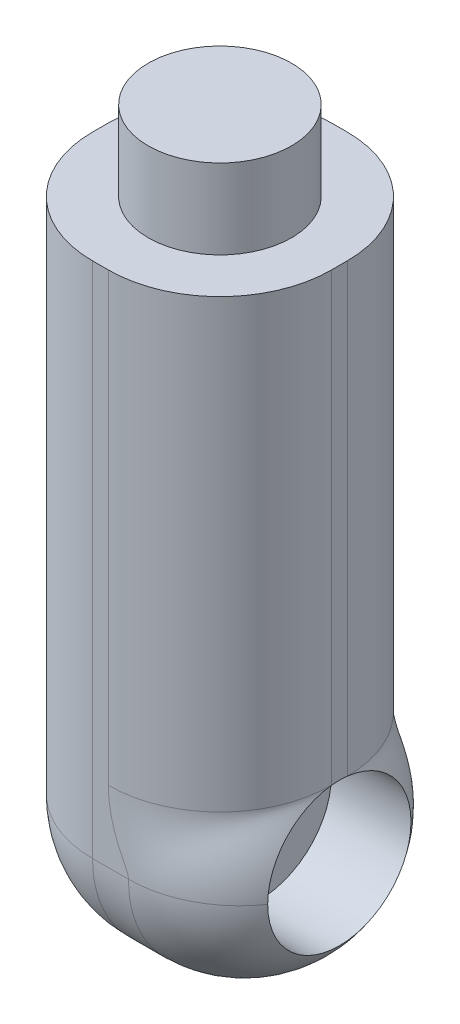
ISO-10303-21;
HEADER;
FILE_DESCRIPTION(('STEP AP214'),'2;1');
FILE_NAME('part.step','',(''),(''),'','','');
FILE_SCHEMA(('AUTOMOTIVE_DESIGN { 1 0 10303 214 1 1 1 1 }'));
ENDSEC;
DATA;
#1=APPLICATION_CONTEXT('core data for automotive mechanical design processes');
#2=APPLICATION_PROTOCOL_DEFINITION('international standard','automotive_design',2000,#1);
#3=PRODUCT_CONTEXT('',#1,'mechanical');
#4=PRODUCT('Part','Part','',(#3));
#5=PRODUCT_RELATED_PRODUCT_CATEGORY('part','',(#4));
#6=PRODUCT_DEFINITION_FORMATION('','',#4);
#7=PRODUCT_DEFINITION_CONTEXT('part definition',#1,'design');
#8=PRODUCT_DEFINITION('design','',#6,#7);
#9=PRODUCT_DEFINITION_SHAPE('','',#8);
#10=(LENGTH_UNIT() NAMED_UNIT(*) SI_UNIT(.MILLI.,.METRE.));
#11=(NAMED_UNIT(*) PLANE_ANGLE_UNIT() SI_UNIT($,.RADIAN.));
#12=(NAMED_UNIT(*) SI_UNIT($,.STERADIAN.) SOLID_ANGLE_UNIT());
#13=UNCERTAINTY_MEASURE_WITH_UNIT(LENGTH_MEASURE(1.E-05),#10,'distance_accuracy_value','');
#14=(GEOMETRIC_REPRESENTATION_CONTEXT(3) GLOBAL_UNCERTAINTY_ASSIGNED_CONTEXT((#13)) GLOBAL_UNIT_ASSIGNED_CONTEXT((#10,
#11,#12)) REPRESENTATION_CONTEXT('',''));
#15=CARTESIAN_POINT('',(0.,0.,0.));
#16=DIRECTION('',(0.,0.,1.));
#17=DIRECTION('',(1.,0.,0.));
#18=AXIS2_PLACEMENT_3D('',#15,#16,#17);
#19=CARTESIAN_POINT('',(150.,0.,-150.));
#20=DIRECTION('',(0.,0.,1.));
#21=DIRECTION('',(1.,0.,0.));
#22=AXIS2_PLACEMENT_3D('',#19,#20,#21);
#23=PLANE('',#22);
#24=DIRECTION('',(-1.,0.,0.));
#25=VECTOR('',#24,1.);
#26=CARTESIAN_POINT('',(150.,400.,-150.));
#27=LINE('',#26,#25);
#28=CARTESIAN_POINT('',(80.,400.,-150.));
#29=VERTEX_POINT('',#28);
#30=CARTESIAN_POINT('',(70.,400.,-150.));
#31=VERTEX_POINT('',#30);
#32=EDGE_CURVE('E177',#29,#31,#27,.T.);
#33=ORIENTED_EDGE('',*,*,#32,.F.);
#34=DIRECTION('',(0.,1.,0.));
#35=VECTOR('',#34,1.);
#36=CARTESIAN_POINT('',(80.,0.,-150.));
#37=LINE('',#36,#35);
#38=CARTESIAN_POINT('',(80.,119.721359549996,-150.));
#39=VERTEX_POINT('',#38);
#40=EDGE_CURVE('E11',#29,#39,#37,.F.);
#41=ORIENTED_EDGE('',*,*,#40,.T.);
#42=CARTESIAN_POINT('',(90.6158343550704,68.8333926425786,-150.));
#43=CARTESIAN_POINT('',(135.150180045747,47.2447731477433,-150.));
#44=CARTESIAN_POINT('',(150.,40.0461243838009,-103.341252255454));
#45=CARTESIAN_POINT('',(90.6554251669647,68.9150653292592,-150.));
#46=CARTESIAN_POINT('',(135.052151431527,47.4550393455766,-150.));
#47=CARTESIAN_POINT('',(150.,40.2297715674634,-103.567713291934));
#48=CARTESIAN_POINT('',(90.6948795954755,68.9968043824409,-150.));
#49=CARTESIAN_POINT('',(134.9531410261,47.6705525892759,-150.));
#50=CARTESIAN_POINT('',(150.,40.420133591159,-103.798025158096));
#51=CARTESIAN_POINT('',(90.7734617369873,69.1604402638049,-150.));
#52=CARTESIAN_POINT('',(134.753473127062,48.112302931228,-150.));
#53=CARTESIAN_POINT('',(150.,40.8156027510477,-104.266387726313));
#54=CARTESIAN_POINT('',(90.8125894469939,69.2423370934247,-150.));
#55=CARTESIAN_POINT('',(134.652826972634,48.3384974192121,-150.));
#56=CARTESIAN_POINT('',(150.,41.0207100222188,-104.504438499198));
#57=CARTESIAN_POINT('',(90.8904686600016,69.4063229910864,-150.));
#58=CARTESIAN_POINT('',(134.449976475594,48.8022820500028,-150.));
#59=CARTESIAN_POINT('',(150.,41.4470101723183,-104.988344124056));
#60=CARTESIAN_POINT('',(90.9292201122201,69.4884120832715,-150.));
#61=CARTESIAN_POINT('',(134.347783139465,49.0398281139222,-150.));
#62=CARTESIAN_POINT('',(150.,41.6682051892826,-105.23420001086));
#63=CARTESIAN_POINT('',(91.0062789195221,69.6527981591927,-150.));
#64=CARTESIAN_POINT('',(134.141995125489,49.5269817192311,-150.));
#65=CARTESIAN_POINT('',(150.,42.1281270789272,-105.733614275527));
#66=CARTESIAN_POINT('',(91.0445862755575,69.7350951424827,-150.));
#67=CARTESIAN_POINT('',(134.038411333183,49.7765406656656,-150.));
#68=CARTESIAN_POINT('',(150.,42.3668539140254,-105.987172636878));
#69=CARTESIAN_POINT('',(91.1590560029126,69.9830211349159,-150.));
#70=CARTESIAN_POINT('',(133.725366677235,50.5454575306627,-150.));
#71=CARTESIAN_POINT('',(150.,43.1137128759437,-106.761327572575));
#72=CARTESIAN_POINT('',(91.234443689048,70.1490092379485,-150.));
#73=CARTESIAN_POINT('',(133.513670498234,51.0849159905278,-150.));
#74=CARTESIAN_POINT('',(150.,43.6507909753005,-107.293406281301));
#75=CARTESIAN_POINT('',(91.3825074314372,70.4821898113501,-150.));
#76=CARTESIAN_POINT('',(133.087194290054,52.2217604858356,-150.));
#77=CARTESIAN_POINT('',(150.,44.8161800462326,-108.385253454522));
#78=CARTESIAN_POINT('',(91.4551835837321,70.6493822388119,-150.));
#79=CARTESIAN_POINT('',(132.872481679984,52.8186892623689,-150.));
#80=CARTESIAN_POINT('',(150.,45.4444877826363,-108.945020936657));
#81=CARTESIAN_POINT('',(91.562866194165,70.9044051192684,-150.));
#82=CARTESIAN_POINT('',(132.545890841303,53.7753644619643,-150.));
#83=CARTESIAN_POINT('',(150.,46.4801851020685,-109.811372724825));
#84=CARTESIAN_POINT('',(91.5991631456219,70.991690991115,-150.));
#85=CARTESIAN_POINT('',(132.434512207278,54.1101603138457,-150.));
#86=CARTESIAN_POINT('',(150.,46.8483015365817,-110.110104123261));
#87=CARTESIAN_POINT('',(91.6706719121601,71.166705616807,-150.));
#88=CARTESIAN_POINT('',(132.212279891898,54.7978887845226,-150.));
#89=CARTESIAN_POINT('',(150.,47.6158303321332,-110.711978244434));
#90=CARTESIAN_POINT('',(91.7058837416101,71.2544343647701,-150.));
#91=CARTESIAN_POINT('',(132.101428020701,55.150756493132,-150.));
#92=CARTESIAN_POINT('',(150.,48.0152422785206,-111.01512090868));
#93=CARTESIAN_POINT('',(91.775077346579,71.4303851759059,-150.));
#94=CARTESIAN_POINT('',(131.880868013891,55.8755037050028,-150.));
#95=CARTESIAN_POINT('',(150.,48.8478130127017,-111.62415983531));
#96=CARTESIAN_POINT('',(91.8090590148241,71.51860728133,-150.));
#97=CARTESIAN_POINT('',(131.771157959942,56.2473232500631,-150.));
#98=CARTESIAN_POINT('',(150.,49.280974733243,-111.930056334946));
#99=CARTESIAN_POINT('',(91.8756234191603,71.6955784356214,-150.));
#100=CARTESIAN_POINT('',(131.5536382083,57.010708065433,-150.));
#101=CARTESIAN_POINT('',(150.,50.1833877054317,-112.542417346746));
#102=CARTESIAN_POINT('',(91.9082061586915,71.7843274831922,-150.));
#103=CARTESIAN_POINT('',(131.445821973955,57.4022173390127,-150.));
#104=CARTESIAN_POINT('',(150.,50.6526388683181,-112.848881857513));
#105=CARTESIAN_POINT('',(91.9717455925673,71.9622671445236,-150.));
#106=CARTESIAN_POINT('',(131.233103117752,58.205060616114,-150.));
#107=CARTESIAN_POINT('',(150.,51.6287715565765,-113.45928421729));
#108=CARTESIAN_POINT('',(92.0027044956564,72.0514569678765,-150.));
#109=CARTESIAN_POINT('',(131.128185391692,58.6163179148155,-150.));
#110=CARTESIAN_POINT('',(150.,52.1355995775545,-113.763224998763));
#111=CARTESIAN_POINT('',(92.0628459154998,72.230435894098,-150.));
#112=CARTESIAN_POINT('',(130.922093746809,59.4596163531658,-150.));
#113=CARTESIAN_POINT('',(150.,53.1893906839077,-114.365793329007));
#114=CARTESIAN_POINT('',(92.092028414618,72.3202250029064,-150.));
#115=CARTESIAN_POINT('',(130.820902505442,59.8916245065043,-150.));
#116=CARTESIAN_POINT('',(150.,53.7363541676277,-114.664420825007));
#117=CARTESIAN_POINT('',(92.1483962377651,72.5004151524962,-150.));
#118=CARTESIAN_POINT('',(130.623390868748,60.7765613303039,-150.));
#119=CARTESIAN_POINT('',(150.,54.8717952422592,-115.25250294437));
#120=CARTESIAN_POINT('',(92.175581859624,72.5908160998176,-150.));
#121=CARTESIAN_POINT('',(130.527046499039,61.2294716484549,-150.));
#122=CARTESIAN_POINT('',(150.,55.4602666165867,-115.541958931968));
#123=CARTESIAN_POINT('',(92.2277284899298,72.7722547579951,-150.));
#124=CARTESIAN_POINT('',(130.340445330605,62.1561135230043,-150.));
#125=CARTESIAN_POINT('',(150.,56.679538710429,-116.107325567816));
#126=CARTESIAN_POINT('',(92.252689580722,72.8632924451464,-150.));
#127=CARTESIAN_POINT('',(130.250159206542,62.6298528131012,-150.));
#128=CARTESIAN_POINT('',(150.,57.3103378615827,-116.383236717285));
#129=CARTESIAN_POINT('',(92.3063744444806,73.0699905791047,-150.));
#130=CARTESIAN_POINT('',(130.054327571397,63.7243136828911,-150.));
#131=CARTESIAN_POINT('',(150.,58.7853347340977,-116.986605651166));
#132=CARTESIAN_POINT('',(92.3343664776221,73.1858427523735,-150.));
#133=CARTESIAN_POINT('',(129.950853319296,64.3515012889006,-150.));
#134=CARTESIAN_POINT('',(150.,59.6420902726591,-117.308587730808));
#135=CARTESIAN_POINT('',(92.385922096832,73.4185307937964,-150.));
#136=CARTESIAN_POINT('',(129.758517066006,65.6360063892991,-150.));
#137=CARTESIAN_POINT('',(150.,61.4200755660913,-117.912312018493));
#138=CARTESIAN_POINT('',(92.4094857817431,73.5353666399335,-150.));
#139=CARTESIAN_POINT('',(129.669576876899,66.2934859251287,-150.));
#140=CARTESIAN_POINT('',(150.,62.3413038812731,-118.194055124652));
#141=CARTESIAN_POINT('',(92.4516973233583,73.7699078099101,-150.));
#142=CARTESIAN_POINT('',(129.509102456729,67.6347099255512,-150.));
#143=CARTESIAN_POINT('',(150.,64.2414929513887,-118.706086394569));
#144=CARTESIAN_POINT('',(92.470346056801,73.8876129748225,-150.));
#145=CARTESIAN_POINT('',(129.437485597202,68.3187099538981,-150.));
#146=CARTESIAN_POINT('',(150.,65.2204433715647,-118.936383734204));
#147=CARTESIAN_POINT('',(92.5022994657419,74.12375135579,-150.));
#148=CARTESIAN_POINT('',(129.31416569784,69.7077233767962,-150.));
#149=CARTESIAN_POINT('',(150.,67.2255714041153,-119.335115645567));
#150=CARTESIAN_POINT('',(92.5156041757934,74.2421845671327,-150.));
#151=CARTESIAN_POINT('',(129.262391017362,70.4130947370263,-150.));
#152=CARTESIAN_POINT('',(150.,68.2517487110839,-119.503550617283));
#153=CARTESIAN_POINT('',(92.5363602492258,74.4776370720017,-150.));
#154=CARTESIAN_POINT('',(129.181412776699,71.8264975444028,-150.));
#155=CARTESIAN_POINT('',(150.,70.3199120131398,-119.767908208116));
#156=CARTESIAN_POINT('',(92.5439027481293,74.594648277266,-150.));
#157=CARTESIAN_POINT('',(129.151807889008,72.5347114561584,-150.));
#158=CARTESIAN_POINT('',(150.,71.3613743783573,-119.86495888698));
#159=CARTESIAN_POINT('',(92.5532865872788,74.8288993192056,-150.));
#160=CARTESIAN_POINT('',(129.114971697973,73.9572625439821,-150.));
#161=CARTESIAN_POINT('',(150.,73.4591524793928,-119.985878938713));
#162=CARTESIAN_POINT('',(92.5551280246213,74.9461391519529,-150.));
#163=CARTESIAN_POINT('',(129.107715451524,74.672069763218,-150.));
#164=CARTESIAN_POINT('',(150.,74.5154679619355,-120.009749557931));
#165=CARTESIAN_POINT('',(92.5530600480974,75.1805758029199,-150.));
#166=CARTESIAN_POINT('',(129.11584539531,76.0997891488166,-150.));
#167=CARTESIAN_POINT('',(150.,76.6248750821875,-119.983025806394));
#168=CARTESIAN_POINT('',(92.5491501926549,75.2977726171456,-150.));
#169=CARTESIAN_POINT('',(129.131238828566,76.8131842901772,-150.));
#170=CARTESIAN_POINT('',(150.,77.6779664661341,-119.932425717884));
#171=CARTESIAN_POINT('',(92.5356831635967,75.5318467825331,-150.));
#172=CARTESIAN_POINT('',(129.184014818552,78.2301433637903,-150.));
#173=CARTESIAN_POINT('',(150.,79.7630449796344,-119.759443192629));
#174=CARTESIAN_POINT('',(92.5261257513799,75.6487241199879,-150.));
#175=CARTESIAN_POINT('',(129.221432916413,78.9341630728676,-150.));
#176=CARTESIAN_POINT('',(150.,80.7950312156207,-119.637057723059));
#177=CARTESIAN_POINT('',(92.5060005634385,75.8401787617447,-150.));
#178=CARTESIAN_POINT('',(129.299666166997,80.0760075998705,-150.));
#179=CARTESIAN_POINT('',(150.,82.4593192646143,-119.382352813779));
#180=CARTESIAN_POINT('',(92.497017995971,75.914927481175,-150.));
#181=CARTESIAN_POINT('',(129.334506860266,80.5192626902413,-150.));
#182=CARTESIAN_POINT('',(150.,83.102505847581,-119.269257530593));
#183=CARTESIAN_POINT('',(92.4769193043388,76.0641400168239,-150.));
#184=CARTESIAN_POINT('',(129.412090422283,81.397248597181,-150.));
#185=CARTESIAN_POINT('',(150.,84.3702104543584,-119.018364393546));
#186=CARTESIAN_POINT('',(92.4658031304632,76.1386038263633,-150.));
#187=CARTESIAN_POINT('',(129.45485143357,81.8320697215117,-150.));
#188=CARTESIAN_POINT('',(150.,84.9947280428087,-118.880565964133));
#189=CARTESIAN_POINT('',(92.4415411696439,76.2872055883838,-150.));
#190=CARTESIAN_POINT('',(129.547663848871,82.6918103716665,-150.));
#191=CARTESIAN_POINT('',(150.,86.222218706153,-118.582804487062));
#192=CARTESIAN_POINT('',(92.4283951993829,76.3613435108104,-150.));
#193=CARTESIAN_POINT('',(129.597735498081,83.1168042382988,-150.));
#194=CARTESIAN_POINT('',(150.,86.8251898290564,-118.422839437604));
#195=CARTESIAN_POINT('',(92.4001904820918,76.5092533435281,-150.));
#196=CARTESIAN_POINT('',(129.704492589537,83.9557161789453,-150.));
#197=CARTESIAN_POINT('',(150.,88.0072943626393,-118.083505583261));
#198=CARTESIAN_POINT('',(92.3851317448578,76.5830252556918,-150.));
#199=CARTESIAN_POINT('',(129.761198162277,84.3696937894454,-150.));
#200=CARTESIAN_POINT('',(150.,88.5864278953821,-117.904136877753));
#201=CARTESIAN_POINT('',(92.353213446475,76.7302279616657,-150.));
#202=CARTESIAN_POINT('',(129.880561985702,85.1859582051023,-150.));
#203=CARTESIAN_POINT('',(150.,89.7196294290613,-117.528685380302));
#204=CARTESIAN_POINT('',(92.3363527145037,76.803658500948,-150.));
#205=CARTESIAN_POINT('',(129.943243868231,85.5882807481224,-150.));
#206=CARTESIAN_POINT('',(150.,90.2736807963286,-117.332591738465));
#207=CARTESIAN_POINT('',(92.3009640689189,76.9501159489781,-150.));
#208=CARTESIAN_POINT('',(130.073822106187,86.3803084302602,-150.));
#209=CARTESIAN_POINT('',(150.,91.3553094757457,-116.926573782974));
#210=CARTESIAN_POINT('',(92.2824361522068,77.0231428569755,-150.));
#211=CARTESIAN_POINT('',(130.141737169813,86.7700429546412,-150.));
#212=CARTESIAN_POINT('',(150.,91.8828867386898,-116.716649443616));
#213=CARTESIAN_POINT('',(92.2438393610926,77.168784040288,-150.));
#214=CARTESIAN_POINT('',(130.282085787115,87.5364516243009,-150.));
#215=CARTESIAN_POINT('',(150.,92.9110679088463,-116.285644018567));
#216=CARTESIAN_POINT('',(92.2237705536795,77.2413983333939,-150.));
#217=CARTESIAN_POINT('',(130.35453612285,87.9131425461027,-150.));
#218=CARTESIAN_POINT('',(150.,93.4116729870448,-116.064563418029));
#219=CARTESIAN_POINT('',(92.1822133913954,77.3862209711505,-150.));
#220=CARTESIAN_POINT('',(130.503296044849,88.6532602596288,-150.));
#221=CARTESIAN_POINT('',(150.,94.3859258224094,-115.613717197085));
#222=CARTESIAN_POINT('',(92.1607249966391,77.4584293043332,-150.));
#223=CARTESIAN_POINT('',(130.579620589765,89.0166912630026,-150.));
#224=CARTESIAN_POINT('',(150.,94.859572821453,-115.383951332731));
#225=CARTESIAN_POINT('',(92.1160871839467,77.6036167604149,-150.));
#226=CARTESIAN_POINT('',(130.736772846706,89.7360279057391,-150.));
#227=CARTESIAN_POINT('',(150.,95.7877327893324,-114.914221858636));
#228=CARTESIAN_POINT('',(92.0929164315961,77.6765893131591,-150.));
#229=CARTESIAN_POINT('',(130.817663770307,90.0916963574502,-150.));
#230=CARTESIAN_POINT('',(150.,96.2418091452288,-114.674153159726));
#231=CARTESIAN_POINT('',(92.0453488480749,77.822134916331,-150.));
#232=CARTESIAN_POINT('',(130.982178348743,90.7893367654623,-150.));
#233=CARTESIAN_POINT('',(150.,97.1231535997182,-114.189526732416));
#234=CARTESIAN_POINT('',(92.020951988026,77.8947079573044,-150.));
#235=CARTESIAN_POINT('',(131.065812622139,91.1312943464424,-150.));
#236=CARTESIAN_POINT('',(150.,97.550421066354,-113.944968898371));
#237=CARTESIAN_POINT('',(91.9710440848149,78.0394679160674,-150.));
#238=CARTESIAN_POINT('',(131.235256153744,91.8016920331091,-150.));
#239=CARTESIAN_POINT('',(150.,98.3790433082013,-113.453250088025));
#240=CARTESIAN_POINT('',(91.9455330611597,78.1116548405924,-150.));
#241=CARTESIAN_POINT('',(131.321073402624,92.1301115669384,-150.));
#242=CARTESIAN_POINT('',(150.,98.7803985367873,-113.206089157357));
#243=CARTESIAN_POINT('',(91.8934997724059,78.2556634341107,-150.));
#244=CARTESIAN_POINT('',(131.49438456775,92.7737278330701,-150.));
#245=CARTESIAN_POINT('',(150.,99.5582892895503,-112.710781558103));
#246=CARTESIAN_POINT('',(91.8669774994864,78.3274851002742,-150.));
#247=CARTESIAN_POINT('',(131.581884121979,93.088898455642,-150.));
#248=CARTESIAN_POINT('',(150.,99.9348246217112,-112.462634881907));
#249=CARTESIAN_POINT('',(91.8130253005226,78.4707637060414,-150.));
#250=CARTESIAN_POINT('',(131.758087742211,93.7062847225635,-150.));
#251=CARTESIAN_POINT('',(150.,100.664164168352,-111.966810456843));
#252=CARTESIAN_POINT('',(91.7855956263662,78.5422207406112,-150.));
#253=CARTESIAN_POINT('',(131.846794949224,94.0084743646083,-150.));
#254=CARTESIAN_POINT('',(150.,101.016974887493,-111.719132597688));
#255=CARTESIAN_POINT('',(91.7299101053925,78.6848119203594,-150.));
#256=CARTESIAN_POINT('',(132.025042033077,94.6003970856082,-150.));
#257=CARTESIAN_POINT('',(150.,101.700233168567,-111.225339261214));
#258=CARTESIAN_POINT('',(91.7016542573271,78.7559460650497,-150.));
#259=CARTESIAN_POINT('',(132.114583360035,94.89009783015,-150.));
#260=CARTESIAN_POINT('',(150.,102.030680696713,-110.979223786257));
#261=CARTESIAN_POINT('',(91.6443992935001,78.897910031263,-150.));
#262=CARTESIAN_POINT('',(132.294145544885,95.4574688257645,-150.));
#263=CARTESIAN_POINT('',(150.,102.670477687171,-110.489533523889));
#264=CARTESIAN_POINT('',(91.615400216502,78.968739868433,-150.));
#265=CARTESIAN_POINT('',(132.384166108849,95.7351058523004,-150.));
#266=CARTESIAN_POINT('',(150.,102.979828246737,-110.245958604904));
#267=CARTESIAN_POINT('',(91.5567318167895,79.1101203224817,-150.));
#268=CARTESIAN_POINT('',(132.56438903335,96.2788219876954,-150.));
#269=CARTESIAN_POINT('',(150.,103.578718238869,-109.762118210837));
#270=CARTESIAN_POINT('',(91.5270624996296,79.1806709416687,-150.));
#271=CARTESIAN_POINT('',(132.654589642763,96.5448665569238,-150.));
#272=CARTESIAN_POINT('',(150.,103.868257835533,-109.521852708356));
#273=CARTESIAN_POINT('',(91.4310009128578,79.4063950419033,-150.));
#274=CARTESIAN_POINT('',(132.94398281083,97.3810725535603,-150.));
#275=CARTESIAN_POINT('',(150.,104.766605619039,-108.758093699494));
#276=CARTESIAN_POINT('',(91.3634473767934,79.5610749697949,-150.));
#277=CARTESIAN_POINT('',(133.142561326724,97.9283628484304,-150.));
#278=CARTESIAN_POINT('',(150.,105.339612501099,-108.242261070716));
#279=CARTESIAN_POINT('',(91.22605161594,79.8694168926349,-150.));
#280=CARTESIAN_POINT('',(133.537077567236,98.9743679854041,-150.));
#281=CARTESIAN_POINT('',(150.,106.408202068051,-107.234508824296));
#282=CARTESIAN_POINT('',(91.1562093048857,80.0230788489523,-150.));
#283=CARTESIAN_POINT('',(133.732960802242,99.4727213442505,-150.));
#284=CARTESIAN_POINT('',(150.,106.903781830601,-106.742590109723));
#285=CARTESIAN_POINT('',(91.01474273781,80.3296046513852,-150.));
#286=CARTESIAN_POINT('',(134.120595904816,100.425782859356,-150.));
#287=CARTESIAN_POINT('',(150.,107.828895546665,-105.784847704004));
#288=CARTESIAN_POINT('',(90.9431182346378,80.4824683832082,-150.));
#289=CARTESIAN_POINT('',(134.312280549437,100.880153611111,-150.));
#290=CARTESIAN_POINT('',(150.,108.258420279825,-105.319027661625));
#291=CARTESIAN_POINT('',(90.7985205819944,80.7875528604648,-150.));
#292=CARTESIAN_POINT('',(134.690468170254,101.749674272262,-150.));
#293=CARTESIAN_POINT('',(150.,109.061178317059,-104.414310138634));
#294=CARTESIAN_POINT('',(90.7255474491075,80.939773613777,-150.));
#295=CARTESIAN_POINT('',(134.876898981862,102.164527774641,-150.));
#296=CARTESIAN_POINT('',(150.,109.434412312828,-103.975412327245));
#297=CARTESIAN_POINT('',(90.5785628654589,81.2438038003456,-150.));
#298=CARTESIAN_POINT('',(135.244032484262,102.959309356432,-150.));
#299=CARTESIAN_POINT('',(150.,110.133178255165,-103.124065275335));
#300=CARTESIAN_POINT('',(90.5045509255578,81.3956129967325,-150.));
#301=CARTESIAN_POINT('',(135.424658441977,103.338957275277,-150.));
#302=CARTESIAN_POINT('',(150.,110.458686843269,-102.711629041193));
#303=CARTESIAN_POINT('',(90.3558107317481,81.69888000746,-150.));
#304=CARTESIAN_POINT('',(135.779722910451,104.066773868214,-150.));
#305=CARTESIAN_POINT('',(150.,111.068917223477,-101.912558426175));
#306=CARTESIAN_POINT('',(90.2810824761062,81.8503378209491,-150.));
#307=CARTESIAN_POINT('',(135.954089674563,104.414713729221,-150.));
#308=CARTESIAN_POINT('',(150.,111.353638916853,-101.525924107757));
#309=CARTESIAN_POINT('',(90.1311539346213,82.1530055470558,-150.));
#310=CARTESIAN_POINT('',(136.296458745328,105.0823573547,-150.));
#311=CARTESIAN_POINT('',(150.,111.888280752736,-100.777242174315));
#312=CARTESIAN_POINT('',(90.0559536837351,82.3042154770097,-150.));
#313=CARTESIAN_POINT('',(136.464393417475,105.401865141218,-150.));
#314=CARTESIAN_POINT('',(150.,112.138203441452,-100.415192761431));
#315=CARTESIAN_POINT('',(89.9052753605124,82.6064965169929,-150.));
#316=CARTESIAN_POINT('',(136.793890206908,106.015567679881,-150.));
#317=CARTESIAN_POINT('',(150.,112.608316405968,-99.7142174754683));
#318=CARTESIAN_POINT('',(89.829797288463,82.7575676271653,-150.));
#319=CARTESIAN_POINT('',(136.955388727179,106.309591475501,-150.));
#320=CARTESIAN_POINT('',(150.,112.828506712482,-99.3752915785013));
#321=CARTESIAN_POINT('',(89.6786667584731,83.0597837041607,-150.));
#322=CARTESIAN_POINT('',(137.272227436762,106.875126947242,-150.));
#323=CARTESIAN_POINT('',(150.,113.243569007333,-98.7187755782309));
#324=CARTESIAN_POINT('',(89.6030142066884,83.2109286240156,-150.));
#325=CARTESIAN_POINT('',(137.427503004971,107.146470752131,-150.));
#326=CARTESIAN_POINT('',(150.,113.438419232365,-98.4012039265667));
#327=CARTESIAN_POINT('',(89.4517416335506,83.5132347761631,-150.));
#328=CARTESIAN_POINT('',(137.731896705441,107.668630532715,-150.));
#329=CARTESIAN_POINT('',(150.,113.80615110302,-97.7862007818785));
#330=CARTESIAN_POINT('',(89.3761216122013,83.6643960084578,-150.));
#331=CARTESIAN_POINT('',(137.880961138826,107.919319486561,-150.));
#332=CARTESIAN_POINT('',(150.,113.979032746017,-97.488769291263));
#333=CARTESIAN_POINT('',(89.2250346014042,83.9667978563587,-150.));
#334=CARTESIAN_POINT('',(138.173127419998,108.402173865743,-150.));
#335=CARTESIAN_POINT('',(150.,114.305836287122,-96.9125739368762));
#336=CARTESIAN_POINT('',(89.149567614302,84.1180384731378,-150.));
#337=CARTESIAN_POINT('',(138.316180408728,108.634229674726,-150.));
#338=CARTESIAN_POINT('',(150.,114.459757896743,-96.6338103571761));
#339=CARTESIAN_POINT('',(88.9988921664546,84.4206484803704,-150.));
#340=CARTESIAN_POINT('',(138.596542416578,109.081581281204,-150.));
#341=CARTESIAN_POINT('',(150.,114.751174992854,-96.0935592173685));
#342=CARTESIAN_POINT('',(88.9236837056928,84.5720178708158,-150.));
#343=CARTESIAN_POINT('',(138.733807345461,109.296782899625,-150.));
#344=CARTESIAN_POINT('',(150.,114.888670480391,-95.8320716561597));
#345=CARTESIAN_POINT('',(88.7736348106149,84.8748905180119,-150.));
#346=CARTESIAN_POINT('',(139.002796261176,109.711940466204,-150.));
#347=CARTESIAN_POINT('',(150.,115.149352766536,-95.3251249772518));
#348=CARTESIAN_POINT('',(88.6987942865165,85.0263937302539,-150.));
#349=CARTESIAN_POINT('',(139.134482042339,109.911819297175,-150.));
#350=CARTESIAN_POINT('',(150.,115.272543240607,-95.0796617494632));
#351=CARTESIAN_POINT('',(88.5495395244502,85.3296099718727,-150.));
#352=CARTESIAN_POINT('',(139.392593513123,110.297770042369,-150.));
#353=CARTESIAN_POINT('',(150.,115.506467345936,-94.6034763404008));
#354=CARTESIAN_POINT('',(88.4751252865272,85.4813230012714,-150.));
#355=CARTESIAN_POINT('',(139.51898344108,110.483771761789,-150.));
#356=CARTESIAN_POINT('',(150.,115.617200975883,-94.3727541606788));
#357=CARTESIAN_POINT('',(88.2526273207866,85.9368246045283,-150.));
#358=CARTESIAN_POINT('',(139.891134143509,111.023686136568,-150.));
#359=CARTESIAN_POINT('',(150.,115.933108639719,-93.7009829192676));
#360=CARTESIAN_POINT('',(88.1052875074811,86.2409773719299,-150.));
#361=CARTESIAN_POINT('',(140.128694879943,111.357711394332,-150.));
#362=CARTESIAN_POINT('',(150.,116.121990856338,-93.2803263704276));
#363=CARTESIAN_POINT('',(87.8143832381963,86.8476614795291,-150.));
#364=CARTESIAN_POINT('',(140.583707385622,111.981254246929,-150.));
#365=CARTESIAN_POINT('',(150.,116.464639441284,-92.489053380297));
#366=CARTESIAN_POINT('',(87.670796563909,87.1501821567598,-150.));
#367=CARTESIAN_POINT('',(140.801130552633,112.27080735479,-150.));
#368=CARTESIAN_POINT('',(150.,116.618711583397,-92.1180139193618));
#369=CARTESIAN_POINT('',(87.3863579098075,87.7565079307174,-150.));
#370=CARTESIAN_POINT('',(141.220016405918,112.815404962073,-150.));
#371=CARTESIAN_POINT('',(150.,116.900962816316,-91.4150143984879));
#372=CARTESIAN_POINT('',(87.2455059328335,88.0603130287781,-150.));
#373=CARTESIAN_POINT('',(141.421315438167,113.070177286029,-150.));
#374=CARTESIAN_POINT('',(150.,117.02914188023,-91.0830543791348));
#375=CARTESIAN_POINT('',(86.9668047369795,88.6693197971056,-150.));
#376=CARTESIAN_POINT('',(141.809534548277,113.550398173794,-150.));
#377=CARTESIAN_POINT('',(150.,117.264939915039,-90.4527629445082));
#378=CARTESIAN_POINT('',(86.8289556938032,88.974521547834,-150.));
#379=CARTESIAN_POINT('',(141.996320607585,113.775635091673,-150.));
#380=CARTESIAN_POINT('',(150.,117.372557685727,-90.1544334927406));
#381=CARTESIAN_POINT('',(86.5564936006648,89.5863670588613,-150.));
#382=CARTESIAN_POINT('',(142.356912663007,114.200977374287,-150.));
#383=CARTESIAN_POINT('',(150.,117.571272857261,-89.5868787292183));
#384=CARTESIAN_POINT('',(86.4218805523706,89.8930108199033,-150.));
#385=CARTESIAN_POINT('',(142.530609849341,114.400919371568,-150.));
#386=CARTESIAN_POINT('',(150.,117.662370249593,-89.317653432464));
#387=CARTESIAN_POINT('',(86.1560670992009,90.5078009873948,-150.));
#388=CARTESIAN_POINT('',(142.866296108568,114.77914797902,-150.));
#389=CARTESIAN_POINT('',(150.,117.831173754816,-88.8044719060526));
#390=CARTESIAN_POINT('',(86.0248669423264,90.8159475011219,-150.));
#391=CARTESIAN_POINT('',(143.028194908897,114.957304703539,-150.));
#392=CARTESIAN_POINT('',(150.,117.908878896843,-88.5605175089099));
#393=CARTESIAN_POINT('',(85.7660461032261,91.4337396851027,-150.));
#394=CARTESIAN_POINT('',(143.341388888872,115.294813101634,-150.));
#395=CARTESIAN_POINT('',(150.,118.05332246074,-88.0946871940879));
#396=CARTESIAN_POINT('',(85.6384254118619,91.7433853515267,-150.));
#397=CARTESIAN_POINT('',(143.49261027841,115.454063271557,-150.));
#398=CARTESIAN_POINT('',(150.,118.12006091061,-87.8728112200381));
#399=CARTESIAN_POINT('',(85.3868920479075,92.3641910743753,-150.));
#400=CARTESIAN_POINT('',(143.785447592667,115.756159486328,-150.));
#401=CARTESIAN_POINT('',(150.,118.244490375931,-87.448410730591));
#402=CARTESIAN_POINT('',(85.2629794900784,92.6753511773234,-150.));
#403=CARTESIAN_POINT('',(143.927001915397,115.898923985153,-150.));
#404=CARTESIAN_POINT('',(150.,118.302181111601,-87.2458868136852));
#405=CARTESIAN_POINT('',(85.0189805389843,93.2991682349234,-150.));
#406=CARTESIAN_POINT('',(144.20137397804,116.170046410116,-150.));
#407=CARTESIAN_POINT('',(150.,118.410029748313,-86.8578989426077));
#408=CARTESIAN_POINT('',(84.8988941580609,93.6118251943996,-150.));
#409=CARTESIAN_POINT('',(144.334140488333,116.298339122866,-150.));
#410=CARTESIAN_POINT('',(150.,118.460187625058,-86.6724350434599));
#411=CARTESIAN_POINT('',(84.5971332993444,94.4124385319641,-150.));
#412=CARTESIAN_POINT('',(144.663374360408,116.610086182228,-150.));
#413=CARTESIAN_POINT('',(150.,118.580284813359,-86.2178865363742));
#414=CARTESIAN_POINT('',(84.4182392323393,94.901446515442,-150.));
#415=CARTESIAN_POINT('',(144.853870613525,116.784197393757,-150.));
#416=CARTESIAN_POINT('',(150.,118.645766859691,-85.9594725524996));
#417=CARTESIAN_POINT('',(84.0702557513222,95.8829446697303,-150.));
#418=CARTESIAN_POINT('',(145.21822815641,117.107069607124,-150.));
#419=CARTESIAN_POINT('',(150.,118.765052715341,-85.4729473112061));
#420=CARTESIAN_POINT('',(83.9011664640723,96.3754348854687,-150.));
#421=CARTESIAN_POINT('',(145.391965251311,117.255686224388,-150.));
#422=CARTESIAN_POINT('',(150.,118.818856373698,-85.2448364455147));
#423=CARTESIAN_POINT('',(83.5730462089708,97.363783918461,-150.));
#424=CARTESIAN_POINT('',(145.724885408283,117.531643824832,-150.));
#425=CARTESIAN_POINT('',(150.,118.917335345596,-84.8140933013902));
#426=CARTESIAN_POINT('',(83.4140157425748,97.8596429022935,-150.));
#427=CARTESIAN_POINT('',(145.883971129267,117.658877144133,-150.));
#428=CARTESIAN_POINT('',(150.,118.962010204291,-84.6114622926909));
#429=CARTESIAN_POINT('',(83.1062433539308,98.8545427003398,-150.));
#430=CARTESIAN_POINT('',(146.189319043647,117.895323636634,-150.));
#431=CARTESIAN_POINT('',(150.,119.044135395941,-84.2278141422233));
#432=CARTESIAN_POINT('',(82.9575013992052,99.3535835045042,-150.));
#433=CARTESIAN_POINT('',(146.335505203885,118.004457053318,-150.));
#434=CARTESIAN_POINT('',(150.,119.081585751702,-84.0467969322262));
#435=CARTESIAN_POINT('',(82.6704822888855,100.354707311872,-150.));
#436=CARTESIAN_POINT('',(146.616530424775,118.207347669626,-150.));
#437=CARTESIAN_POINT('',(150.,119.150704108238,-83.7032178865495));
#438=CARTESIAN_POINT('',(82.5322059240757,100.856790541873,-150.));
#439=CARTESIAN_POINT('',(146.751308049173,118.301043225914,-150.));
#440=CARTESIAN_POINT('',(150.,119.182371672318,-83.5406574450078));
#441=CARTESIAN_POINT('',(82.2662922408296,101.863766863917,-150.));
#442=CARTESIAN_POINT('',(147.01074375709,118.475200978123,-150.));
#443=CARTESIAN_POINT('',(150.,119.241024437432,-83.2314330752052));
#444=CARTESIAN_POINT('',(82.1386549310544,102.368659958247,-150.));
#445=CARTESIAN_POINT('',(147.135353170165,118.555616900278,-150.));
#446=CARTESIAN_POINT('',(150.,119.268009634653,-83.0847691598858));
#447=CARTESIAN_POINT('',(81.8941617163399,103.381043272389,-150.));
#448=CARTESIAN_POINT('',(147.375507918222,118.704992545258,-150.));
#449=CARTESIAN_POINT('',(150.,119.31815491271,-82.8052104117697));
#450=CARTESIAN_POINT('',(81.7773056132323,103.888533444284,-150.));
#451=CARTESIAN_POINT('',(147.491013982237,118.773916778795,-150.));
#452=CARTESIAN_POINT('',(150.,119.34131506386,-82.6723153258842));
#453=CARTESIAN_POINT('',(81.554493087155,104.905904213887,-150.));
#454=CARTESIAN_POINT('',(147.713860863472,118.901776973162,-150.));
#455=CARTESIAN_POINT('',(150.,119.384477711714,-82.4185327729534));
#456=CARTESIAN_POINT('',(81.4485369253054,105.415784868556,-150.));
#457=CARTESIAN_POINT('',(147.821169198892,118.960684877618,-150.));
#458=CARTESIAN_POINT('',(150.,119.404480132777,-82.2976455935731));
#459=CARTESIAN_POINT('',(81.1452452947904,106.958546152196,-150.));
#460=CARTESIAN_POINT('',(148.134303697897,119.125532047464,-150.));
#461=CARTESIAN_POINT('',(150.,119.4609395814,-81.9484738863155));
#462=CARTESIAN_POINT('',(80.9648417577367,107.99481293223,-150.));
#463=CARTESIAN_POINT('',(148.328391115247,119.217809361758,-150.));
#464=CARTESIAN_POINT('',(150.,119.493388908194,-81.7363057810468));
#465=CARTESIAN_POINT('',(80.649659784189,110.07423408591,-150.));
#466=CARTESIAN_POINT('',(148.691782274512,119.374908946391,-150.));
#467=CARTESIAN_POINT('',(150.,119.550844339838,-81.3451515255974));
#468=CARTESIAN_POINT('',(80.5148816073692,111.117388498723,-150.));
#469=CARTESIAN_POINT('',(148.860935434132,119.439620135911,-150.));
#470=CARTESIAN_POINT('',(150.,119.575850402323,-81.1661655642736));
#471=CARTESIAN_POINT('',(80.2914613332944,113.20872355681,-150.));
#472=CARTESIAN_POINT('',(149.178312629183,119.547318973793,-150.));
#473=CARTESIAN_POINT('',(150.,119.620471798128,-80.8345054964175));
#474=CARTESIAN_POINT('',(80.2028229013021,114.256904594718,-150.));
#475=CARTESIAN_POINT('',(149.326428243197,119.590234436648,-150.));
#476=CARTESIAN_POINT('',(150.,119.640086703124,-80.6818334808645));
#477=CARTESIAN_POINT('',(80.0720767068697,116.356161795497,-150.));
#478=CARTESIAN_POINT('',(149.604694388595,119.658664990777,-150.));
#479=CARTESIAN_POINT('',(150.,119.675333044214,-80.3976879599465));
#480=CARTESIAN_POINT('',(80.0299687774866,117.407237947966,-150.));
#481=CARTESIAN_POINT('',(149.734767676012,119.684134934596,-150.));
#482=CARTESIAN_POINT('',(150.,119.6909644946,-80.2662143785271));
#483=CARTESIAN_POINT('',(79.992752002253,119.497113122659,-150.));
#484=CARTESIAN_POINT('',(149.977759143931,119.720760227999,-150.));
#485=CARTESIAN_POINT('',(150.,119.719048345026,-80.0221094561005));
#486=CARTESIAN_POINT('',(79.9970637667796,120.535901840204,-150.));
#487=CARTESIAN_POINT('',(150.090818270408,119.732062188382,-150.));
#488=CARTESIAN_POINT('',(150.,119.731537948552,-79.909263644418));
#489=CARTESIAN_POINT('',(80.0514004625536,122.612283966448,-150.));
#490=CARTESIAN_POINT('',(150.303491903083,119.743435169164,-150.));
#491=CARTESIAN_POINT('',(150.,119.754265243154,-79.6975582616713));
#492=CARTESIAN_POINT('',(80.1014253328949,123.649877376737,-150.));
#493=CARTESIAN_POINT('',(150.403065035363,119.743488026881,-150.));
#494=CARTESIAN_POINT('',(150.,119.764502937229,-79.5986986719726));
#495=CARTESIAN_POINT('',(80.2471770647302,125.721786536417,-150.));
#496=CARTESIAN_POINT('',(150.590217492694,119.734364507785,-150.));
#497=CARTESIAN_POINT('',(150.,119.78322051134,-79.412695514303));
#498=CARTESIAN_POINT('',(80.3429011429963,126.756102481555,-150.));
#499=CARTESIAN_POINT('',(150.677765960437,119.72517708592,-150.));
#500=CARTESIAN_POINT('',(150.,119.791700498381,-79.3255512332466));
#501=CARTESIAN_POINT('',(80.5799356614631,128.819496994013,-150.));
#502=CARTESIAN_POINT('',(150.842071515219,119.69919748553,-150.));
#503=CARTESIAN_POINT('',(150.,119.807271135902,-79.1611608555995));
#504=CARTESIAN_POINT('',(80.7212459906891,129.848575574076,-150.));
#505=CARTESIAN_POINT('',(150.918804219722,119.682398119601,-150.));
#506=CARTESIAN_POINT('',(150.,119.814361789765,-79.0839147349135));
#507=CARTESIAN_POINT('',(81.0473391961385,131.887622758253,-150.));
#508=CARTESIAN_POINT('',(151.061641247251,119.642762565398,-150.));
#509=CARTESIAN_POINT('',(150.,119.827355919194,-78.9387062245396));
#510=CARTESIAN_POINT('',(81.2316007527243,132.897674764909,-150.));
#511=CARTESIAN_POINT('',(151.127840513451,119.619994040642,-150.));
#512=CARTESIAN_POINT('',(150.,119.833272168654,-78.8706468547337));
#513=CARTESIAN_POINT('',(81.6441407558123,134.9087475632,-150.));
#514=CARTESIAN_POINT('',(151.251474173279,119.569410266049,-150.));
#515=CARTESIAN_POINT('',(150.,119.844223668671,-78.741628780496));
#516=CARTESIAN_POINT('',(81.8724190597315,135.90976838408,-150.));
#517=CARTESIAN_POINT('',(151.308894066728,119.541592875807,-150.));
#518=CARTESIAN_POINT('',(150.,119.849258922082,-78.6806700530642));
#519=CARTESIAN_POINT('',(82.3726399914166,137.901019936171,-150.));
#520=CARTESIAN_POINT('',(151.415673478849,119.481825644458,-150.));
#521=CARTESIAN_POINT('',(150.,119.858610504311,-78.5648915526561));
#522=CARTESIAN_POINT('',(82.6445899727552,138.891248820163,-150.));
#523=CARTESIAN_POINT('',(151.465020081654,119.449874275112,-150.));
#524=CARTESIAN_POINT('',(150.,119.862926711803,-78.510072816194));
#525=CARTESIAN_POINT('',(83.231620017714,140.858850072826,-150.));
#526=CARTESIAN_POINT('',(151.556219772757,119.382601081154,-150.));
#527=CARTESIAN_POINT('',(150.,119.870959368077,-78.4058283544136));
#528=CARTESIAN_POINT('',(83.5467005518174,141.836222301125,-150.));
#529=CARTESIAN_POINT('',(151.598063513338,119.347279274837,-150.));
#530=CARTESIAN_POINT('',(150.,119.874675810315,-78.3564026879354));
#531=CARTESIAN_POINT('',(83.8830899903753,142.806207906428,-150.));
#532=CARTESIAN_POINT('',(151.63644161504,119.310666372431,-150.));
#533=CARTESIAN_POINT('',(150.,119.878152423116,-78.3092952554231));
#534=(BOUNDED_SURFACE() B_SPLINE_SURFACE(3,2,((#42,#43,#44),(#45,#46,#47),(#48,#49,#50),(#51,
#52,#53),(#54,#55,#56),(#57,#58,#59),(#60,#61,#62),(#63,#64,#65),(#66,#67,#68),(#69,#70,#71),
(#72,#73,#74),(#75,#76,#77),(#78,#79,#80),(#81,#82,#83),(#84,#85,#86),(#87,#88,#89),(#90,#91,
#92),(#93,#94,#95),(#96,#97,#98),(#99,#100,#101),(#102,#103,#104),(#105,#106,#107),(#108,#109,
#110),(#111,#112,#113),(#114,#115,#116),(#117,#118,#119),(#120,#121,#122),(#123,#124,#125),
(#126,#127,#128),(#129,#130,#131),(#132,#133,#134),(#135,#136,#137),(#138,#139,#140),(#141,#142,
#143),(#144,#145,#146),(#147,#148,#149),(#150,#151,#152),(#153,#154,#155),(#156,#157,#158),
(#159,#160,#161),(#162,#163,#164),(#165,#166,#167),(#168,#169,#170),(#171,#172,#173),(#174,#175,
#176),(#177,#178,#179),(#180,#181,#182),(#183,#184,#185),(#186,#187,#188),(#189,#190,#191),
(#192,#193,#194),(#195,#196,#197),(#198,#199,#200),(#201,#202,#203),(#204,#205,#206),(#207,#208,
#209),(#210,#211,#212),(#213,#214,#215),(#216,#217,#218),(#219,#220,#221),(#222,#223,#224),
(#225,#226,#227),(#228,#229,#230),(#231,#232,#233),(#234,#235,#236),(#237,#238,#239),(#240,#241,
#242),(#243,#244,#245),(#246,#247,#248),(#249,#250,#251),(#252,#253,#254),(#255,#256,#257),
(#258,#259,#260),(#261,#262,#263),(#264,#265,#266),(#267,#268,#269),(#270,#271,#272),(#273,#274,
#275),(#276,#277,#278),(#279,#280,#281),(#282,#283,#284),(#285,#286,#287),(#288,#289,#290),
(#291,#292,#293),(#294,#295,#296),(#297,#298,#299),(#300,#301,#302),(#303,#304,#305),(#306,#307,
#308),(#309,#310,#311),(#312,#313,#314),(#315,#316,#317),(#318,#319,#320),(#321,#322,#323),
(#324,#325,#326),(#327,#328,#329),(#330,#331,#332),(#333,#334,#335),(#336,#337,#338),(#339,#340,
#341),(#342,#343,#344),(#345,#346,#347),(#348,#349,#350),(#351,#352,#353),(#354,#355,#356),
(#357,#358,#359),(#360,#361,#362),(#363,#364,#365),(#366,#367,#368),(#369,#370,#371),(#372,#373,
#374),(#375,#376,#377),(#378,#379,#380),(#381,#382,#383),(#384,#385,#386),(#387,#388,#389),
(#390,#391,#392),(#393,#394,#395),(#396,#397,#398),(#399,#400,#401),(#402,#403,#404),(#405,#406,
#407),(#408,#409,#410),(#411,#412,#413),(#414,#415,#416),(#417,#418,#419),(#420,#421,#422),
(#423,#424,#425),(#426,#427,#428),(#429,#430,#431),(#432,#433,#434),(#435,#436,#437),(#438,#439,
#440),(#441,#442,#443),(#444,#445,#446),(#447,#448,#449),(#450,#451,#452),(#453,#454,#455),
(#456,#457,#458),(#459,#460,#461),(#462,#463,#464),(#465,#466,#467),(#468,#469,#470),(#471,#472,
#473),(#474,#475,#476),(#477,#478,#479),(#480,#481,#482),(#483,#484,#485),(#486,#487,#488),
(#489,#490,#491),(#492,#493,#494),(#495,#496,#497),(#498,#499,#500),(#501,#502,#503),(#504,#505,
#506),(#507,#508,#509),(#510,#511,#512),(#513,#514,#515),(#516,#517,#518),(#519,#520,#521),
(#522,#523,#524),(#525,#526,#527),(#528,#529,#530),(#531,#532,#533)),.UNSPECIFIED.,.F.,.F.,
.F.) B_SPLINE_SURFACE_WITH_KNOTS((4,2,2,2,2,2,2,2,2,2,2,2,2,2,2,2,2,2,2,2,2,2,2,2,2,2,2,2,2,2,2,
2,2,2,2,2,2,2,2,2,2,2,2,2,2,2,2,2,2,2,2,2,2,2,2,2,2,2,2,2,2,2,2,2,2,2,2,2,2,2,2,2,2,2,2,2,2,2,2,
2,2,4),(3,3),(0.,0.272288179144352,0.544578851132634,0.816905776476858,1.08923211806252,
1.63613128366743,2.18301105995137,2.46660102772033,2.75018723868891,3.03379811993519,
3.31740830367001,3.60062214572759,3.88383879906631,4.16701312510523,4.45017696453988,
4.8076552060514,5.16512546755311,5.52253191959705,5.87993606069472,6.23156323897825,
6.58318442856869,6.93483261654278,7.28649566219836,7.51232684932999,7.73816329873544,
7.96402015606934,8.1898758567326,8.41587920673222,8.64188297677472,8.86787692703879,
9.0938772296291,9.32355404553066,9.5532362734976,9.78291448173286,10.0125944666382,
10.242211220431,10.4718283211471,10.701433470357,10.9310367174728,11.4373732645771,
11.9437289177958,12.4501551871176,12.9565752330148,13.463242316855,13.9699106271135,
14.4765418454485,14.9831725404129,15.490235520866,15.9972985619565,16.504369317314,
17.0114400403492,17.518380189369,18.025320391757,19.0391951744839,20.0437841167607,
21.048374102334,22.0530227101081,23.0576718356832,24.0623937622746,25.0671131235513,
26.0718635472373,27.0766172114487,28.6386193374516,30.2006416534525,31.7627417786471,
33.3248369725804,34.8870500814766,36.449264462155,38.0114501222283,39.5736731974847,
42.7281363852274,45.8826175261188,49.0373492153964,52.1920695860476,55.3074602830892,
58.4228468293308,61.5380436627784,64.6532329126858,67.7324176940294,70.8115925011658,
73.8912863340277,76.9710137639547),(0.,1.),
.UNSPECIFIED.) GEOMETRIC_REPRESENTATION_ITEM() RATIONAL_B_SPLINE_SURFACE(((1.,0.816531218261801,
1.),(1.,0.817521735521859,1.),(1.,0.818527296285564,1.),(1.,0.820568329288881,1.),(1.,
0.821603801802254,1.),(1.,0.823704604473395,1.),(1.,0.824769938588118,1.),(1.,0.82692968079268,
1.),(1.,0.828024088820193,1.),(1.,0.831358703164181,1.),(1.,0.833641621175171,1.),(1.,
0.838306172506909,1.),(1.,0.840687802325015,1.),(1.,0.844357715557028,1.),(1.,0.845620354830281,
1.),(1.,0.848158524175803,1.),(1.,0.849434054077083,1.),(1.,0.851990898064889,1.),(1.,
0.853272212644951,1.),(1.,0.855831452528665,1.),(1.,0.857109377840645,1.),(1.,0.85964905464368,
1.),(1.,0.860910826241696,1.),(1.,0.86340692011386,1.),(1.,0.864641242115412,1.),(1.,
0.867066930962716,1.),(1.,0.868258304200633,1.),(1.,0.870580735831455,1.),(1.,0.871711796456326,
1.),(1.,0.874180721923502,1.),(1.,0.875494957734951,1.),(1.,0.877954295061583,1.),(1.,
0.879099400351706,1.),(1.,0.881177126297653,1.),(1.,0.882109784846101,1.),(1.,0.883722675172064,
1.),(1.,0.8844029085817,1.),(1.,0.885469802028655,1.),(1.,0.885861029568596,1.),(1.,
0.886348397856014,1.),(1.,0.88644454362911,1.),(1.,0.886336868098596,1.),(1.,0.886133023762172,
1.),(1.,0.885435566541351,1.),(1.,0.884941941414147,1.),(1.,0.883913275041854,1.),(1.,
0.883456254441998,1.),(1.,0.882441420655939,1.),(1.,0.881883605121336,1.),(1.,0.880676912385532,
1.),(1.,0.880028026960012,1.),(1.,0.878649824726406,1.),(1.,0.877920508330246,1.),(1.,
0.87639182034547,1.),(1.,0.875592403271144,1.),(1.,0.8739347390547,1.),(1.,0.873076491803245,
1.),(1.,0.87131162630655,1.),(1.,0.870405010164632,1.),(1.,0.868553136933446,1.),(1.,
0.867607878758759,1.),(1.,0.865672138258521,1.),(1.,0.86468117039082,1.),(1.,0.862677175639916,
1.),(1.,0.861664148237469,1.),(1.,0.859623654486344,1.),(1.,0.858596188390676,1.),(1.,
0.856533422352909,1.),(1.,0.855498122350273,1.),(1.,0.853425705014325,1.),(1.,0.852388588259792,
1.),(1.,0.850317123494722,1.),(1.,0.849282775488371,1.),(1.,0.847221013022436,1.),(1.,
0.846193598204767,1.),(1.,0.844149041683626,1.),(1.,0.843131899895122,1.),(1.,0.839892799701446,
1.),(1.,0.837696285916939,1.),(1.,0.833388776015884,1.),(1.,0.831277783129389,1.),(1.,
0.827152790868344,1.),(1.,0.825138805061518,1.),(1.,0.821213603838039,1.),(1.,0.819302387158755,
1.),(1.,0.815582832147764,1.),(1.,0.813774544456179,1.),(1.,0.810260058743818,1.),(1.,
0.808553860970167,1.),(1.,0.805240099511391,1.),(1.,0.803632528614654,1.),(1.,0.800511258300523,
1.),(1.,0.798997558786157,1.),(1.,0.796057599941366,1.),(1.,0.794631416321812,1.),(1.,
0.791862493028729,1.),(1.,0.790519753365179,1.),(1.,0.787912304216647,1.),(1.,0.786647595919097,
1.),(1.,0.784190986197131,1.),(1.,0.782999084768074,1.),(1.,0.780683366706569,1.),(1.,
0.779559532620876,1.),(1.,0.777374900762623,1.),(1.,0.776314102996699,1.),(1.,0.773219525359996,
1.),(1.,0.771273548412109,1.),(1.,0.767600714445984,1.),(1.,0.765872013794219,1.),(1.,
0.762586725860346,1.),(1.,0.761030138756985,1.),(1.,0.758066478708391,1.),(1.,0.75665941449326,
1.),(1.,0.753975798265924,1.),(1.,0.752699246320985,1.),(1.,0.750260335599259,1.),(1.,
0.749097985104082,1.),(1.,0.74687377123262,1.),(1.,0.745811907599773,1.),(1.,0.743776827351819,
1.),(1.,0.742803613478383,1.),(1.,0.740935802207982,1.),(1.,0.740041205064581,1.),(1.,
0.737845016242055,1.),(1.,0.736592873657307,1.),(1.,0.734230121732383,1.),(1.,0.733119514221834,
1.),(1.,0.731018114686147,1.),(1.,0.730027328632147,1.),(1.,0.728148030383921,1.),(1.,
0.727259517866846,1.),(1.,0.725570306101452,1.),(1.,0.724769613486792,1.),(1.,0.723244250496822,
1.),(1.,0.722519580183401,1.),(1.,0.7211363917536,1.),(1.,0.720477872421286,1.),(1.,
0.719218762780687,1.),(1.,0.71861817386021,1.),(1.,0.716881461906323,1.),(1.,0.715823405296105,
1.),(1.,0.713869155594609,1.),(1.,0.712972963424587,1.),(1.,0.71130966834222,1.),(1.,
0.710542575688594,1.),(1.,0.709112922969,1.),(1.,0.708450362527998,1.),(1.,0.707218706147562,
1.),(1.,0.706648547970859,1.),(1.,0.705577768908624,1.),(1.,0.705077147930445,1.),(1.,
0.704134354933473,1.),(1.,0.703692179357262,1.),(1.,0.702857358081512,1.),(1.,0.702464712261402,
1.),(1.,0.701726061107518,1.),(1.,0.70137956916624,1.),(1.,0.700722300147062,1.),(1.,
0.700411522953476,1.),(1.,0.699820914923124,1.),(1.,0.699541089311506,1.),(1.,0.699008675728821,
1.),(1.,0.698756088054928,1.),(1.,0.698515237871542,1.))) REPRESENTATION_ITEM('') SURFACE());
#535=CARTESIAN_POINT('',(83.8830899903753,142.806207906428,-150.));
#536=CARTESIAN_POINT('',(83.5467005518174,141.836222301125,-150.));
#537=CARTESIAN_POINT('',(83.231620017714,140.858850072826,-150.));
#538=CARTESIAN_POINT('',(82.6445899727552,138.891248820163,-150.));
#539=CARTESIAN_POINT('',(82.3726399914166,137.901019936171,-150.));
#540=CARTESIAN_POINT('',(81.8724190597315,135.90976838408,-150.));
#541=CARTESIAN_POINT('',(81.6441407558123,134.9087475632,-150.));
#542=CARTESIAN_POINT('',(81.2316007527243,132.897674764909,-150.));
#543=CARTESIAN_POINT('',(81.0473391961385,131.887622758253,-150.));
#544=CARTESIAN_POINT('',(80.7212459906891,129.848575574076,-150.));
#545=CARTESIAN_POINT('',(80.5799356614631,128.819496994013,-150.));
#546=CARTESIAN_POINT('',(80.3429011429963,126.756102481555,-150.));
#547=CARTESIAN_POINT('',(80.2471770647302,125.721786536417,-150.));
#548=CARTESIAN_POINT('',(80.1014253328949,123.649877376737,-150.));
#549=CARTESIAN_POINT('',(80.0514004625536,122.612283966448,-150.));
#550=CARTESIAN_POINT('',(79.9970637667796,120.535901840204,-150.));
#551=CARTESIAN_POINT('',(79.992752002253,119.497113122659,-150.));
#552=CARTESIAN_POINT('',(80.0299687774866,117.407237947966,-150.));
#553=CARTESIAN_POINT('',(80.0720767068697,116.356161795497,-150.));
#554=CARTESIAN_POINT('',(80.2028229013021,114.256904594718,-150.));
#555=CARTESIAN_POINT('',(80.2914613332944,113.20872355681,-150.));
#556=CARTESIAN_POINT('',(80.5148816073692,111.117388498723,-150.));
#557=CARTESIAN_POINT('',(80.649659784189,110.07423408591,-150.));
#558=CARTESIAN_POINT('',(80.9648417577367,107.99481293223,-150.));
#559=CARTESIAN_POINT('',(81.1452452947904,106.958546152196,-150.));
#560=CARTESIAN_POINT('',(81.4485369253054,105.415784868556,-150.));
#561=CARTESIAN_POINT('',(81.554493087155,104.905904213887,-150.));
#562=CARTESIAN_POINT('',(81.7773056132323,103.888533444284,-150.));
#563=CARTESIAN_POINT('',(81.8941617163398,103.381043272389,-150.));
#564=CARTESIAN_POINT('',(82.1386549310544,102.368659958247,-150.));
#565=CARTESIAN_POINT('',(82.2662922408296,101.863766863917,-150.));
#566=CARTESIAN_POINT('',(82.5322059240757,100.856790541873,-150.));
#567=CARTESIAN_POINT('',(82.6704822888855,100.354707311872,-150.));
#568=CARTESIAN_POINT('',(82.9575013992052,99.3535835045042,-150.));
#569=CARTESIAN_POINT('',(83.1062433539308,98.8545427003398,-150.));
#570=CARTESIAN_POINT('',(83.4140157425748,97.8596429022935,-150.));
#571=CARTESIAN_POINT('',(83.5730462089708,97.363783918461,-150.));
#572=CARTESIAN_POINT('',(83.9011664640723,96.3754348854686,-150.));
#573=CARTESIAN_POINT('',(84.0702557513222,95.8829446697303,-150.));
#574=CARTESIAN_POINT('',(84.4182392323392,94.901446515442,-150.));
#575=CARTESIAN_POINT('',(84.5971332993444,94.4124385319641,-150.));
#576=CARTESIAN_POINT('',(84.8988941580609,93.6118251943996,-150.));
#577=CARTESIAN_POINT('',(85.0189805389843,93.2991682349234,-150.));
#578=CARTESIAN_POINT('',(85.2629794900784,92.6753511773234,-150.));
#579=CARTESIAN_POINT('',(85.3868920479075,92.3641910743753,-150.));
#580=CARTESIAN_POINT('',(85.6384254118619,91.7433853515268,-150.));
#581=CARTESIAN_POINT('',(85.7660461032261,91.4337396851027,-150.));
#582=CARTESIAN_POINT('',(86.0248669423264,90.8159475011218,-150.));
#583=CARTESIAN_POINT('',(86.1560670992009,90.5078009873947,-150.));
#584=CARTESIAN_POINT('',(86.4218805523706,89.8930108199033,-150.));
#585=CARTESIAN_POINT('',(86.5564936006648,89.5863670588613,-150.));
#586=CARTESIAN_POINT('',(86.8289556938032,88.974521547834,-150.));
#587=CARTESIAN_POINT('',(86.9668047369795,88.6693197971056,-150.));
#588=CARTESIAN_POINT('',(87.2455059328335,88.0603130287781,-150.));
#589=CARTESIAN_POINT('',(87.3863579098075,87.7565079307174,-150.));
#590=CARTESIAN_POINT('',(87.670796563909,87.1501821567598,-150.));
#591=CARTESIAN_POINT('',(87.8143832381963,86.8476614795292,-150.));
#592=CARTESIAN_POINT('',(88.1052875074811,86.2409773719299,-150.));
#593=CARTESIAN_POINT('',(88.2526273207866,85.9368246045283,-150.));
#594=CARTESIAN_POINT('',(88.4751252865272,85.4813230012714,-150.));
#595=CARTESIAN_POINT('',(88.5495395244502,85.3296099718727,-150.));
#596=CARTESIAN_POINT('',(88.6987942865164,85.0263937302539,-150.));
#597=CARTESIAN_POINT('',(88.7736348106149,84.8748905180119,-150.));
#598=CARTESIAN_POINT('',(88.9236837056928,84.5720178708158,-150.));
#599=CARTESIAN_POINT('',(88.9988921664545,84.4206484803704,-150.));
#600=CARTESIAN_POINT('',(89.149567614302,84.1180384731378,-150.));
#601=CARTESIAN_POINT('',(89.2250346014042,83.9667978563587,-150.));
#602=CARTESIAN_POINT('',(89.3761216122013,83.6643960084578,-150.));
#603=CARTESIAN_POINT('',(89.4517416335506,83.5132347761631,-150.));
#604=CARTESIAN_POINT('',(89.6030142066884,83.2109286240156,-150.));
#605=CARTESIAN_POINT('',(89.6786667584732,83.0597837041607,-150.));
#606=CARTESIAN_POINT('',(89.829797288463,82.7575676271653,-150.));
#607=CARTESIAN_POINT('',(89.9052753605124,82.6064965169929,-150.));
#608=CARTESIAN_POINT('',(90.0559536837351,82.3042154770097,-150.));
#609=CARTESIAN_POINT('',(90.1311539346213,82.1530055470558,-150.));
#610=CARTESIAN_POINT('',(90.2810824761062,81.8503378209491,-150.));
#611=CARTESIAN_POINT('',(90.3558107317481,81.69888000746,-150.));
#612=CARTESIAN_POINT('',(90.5045509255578,81.3956129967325,-150.));
#613=CARTESIAN_POINT('',(90.5785628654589,81.2438038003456,-150.));
#614=CARTESIAN_POINT('',(90.7255474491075,80.939773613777,-150.));
#615=CARTESIAN_POINT('',(90.7985205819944,80.7875528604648,-150.));
#616=CARTESIAN_POINT('',(90.9431182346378,80.4824683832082,-150.));
#617=CARTESIAN_POINT('',(91.01474273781,80.3296046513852,-150.));
#618=CARTESIAN_POINT('',(91.1562093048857,80.0230788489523,-150.));
#619=CARTESIAN_POINT('',(91.22605161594,79.8694168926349,-150.));
#620=CARTESIAN_POINT('',(91.3634473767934,79.5610749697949,-150.));
#621=CARTESIAN_POINT('',(91.4310009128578,79.4063950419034,-150.));
#622=CARTESIAN_POINT('',(91.5270624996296,79.1806709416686,-150.));
#623=CARTESIAN_POINT('',(91.5567318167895,79.1101203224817,-150.));
#624=CARTESIAN_POINT('',(91.615400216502,78.968739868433,-150.));
#625=CARTESIAN_POINT('',(91.6443992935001,78.897910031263,-150.));
#626=CARTESIAN_POINT('',(91.7016542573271,78.7559460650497,-150.));
#627=CARTESIAN_POINT('',(91.7299101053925,78.6848119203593,-150.));
#628=CARTESIAN_POINT('',(91.7855956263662,78.5422207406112,-150.));
#629=CARTESIAN_POINT('',(91.8130253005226,78.4707637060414,-150.));
#630=CARTESIAN_POINT('',(91.8669774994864,78.3274851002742,-150.));
#631=CARTESIAN_POINT('',(91.8934997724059,78.2556634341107,-150.));
#632=CARTESIAN_POINT('',(91.9455330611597,78.1116548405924,-150.));
#633=CARTESIAN_POINT('',(91.9710440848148,78.0394679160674,-150.));
#634=CARTESIAN_POINT('',(92.020951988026,77.8947079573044,-150.));
#635=CARTESIAN_POINT('',(92.0453488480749,77.822134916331,-150.));
#636=CARTESIAN_POINT('',(92.0929164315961,77.6765893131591,-150.));
#637=CARTESIAN_POINT('',(92.1160871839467,77.6036167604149,-150.));
#638=CARTESIAN_POINT('',(92.1607249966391,77.4584293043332,-150.));
#639=CARTESIAN_POINT('',(92.1822133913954,77.3862209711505,-150.));
#640=CARTESIAN_POINT('',(92.2237705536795,77.2413983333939,-150.));
#641=CARTESIAN_POINT('',(92.2438393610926,77.168784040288,-150.));
#642=CARTESIAN_POINT('',(92.2824361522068,77.0231428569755,-150.));
#643=CARTESIAN_POINT('',(92.3009640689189,76.9501159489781,-150.));
#644=CARTESIAN_POINT('',(92.3363527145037,76.803658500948,-150.));
#645=CARTESIAN_POINT('',(92.353213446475,76.7302279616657,-150.));
#646=CARTESIAN_POINT('',(92.3851317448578,76.5830252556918,-150.));
#647=CARTESIAN_POINT('',(92.4001904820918,76.5092533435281,-150.));
#648=CARTESIAN_POINT('',(92.4283951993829,76.3613435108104,-150.));
#649=CARTESIAN_POINT('',(92.4415411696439,76.2872055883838,-150.));
#650=CARTESIAN_POINT('',(92.4658031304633,76.1386038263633,-150.));
#651=CARTESIAN_POINT('',(92.4769193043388,76.0641400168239,-150.));
#652=CARTESIAN_POINT('',(92.497017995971,75.914927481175,-150.));
#653=CARTESIAN_POINT('',(92.5060005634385,75.8401787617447,-150.));
#654=CARTESIAN_POINT('',(92.5261257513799,75.6487241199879,-150.));
#655=CARTESIAN_POINT('',(92.5356831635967,75.5318467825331,-150.));
#656=CARTESIAN_POINT('',(92.5491501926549,75.2977726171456,-150.));
#657=CARTESIAN_POINT('',(92.5530600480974,75.1805758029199,-150.));
#658=CARTESIAN_POINT('',(92.5551280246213,74.9461391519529,-150.));
#659=CARTESIAN_POINT('',(92.5532865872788,74.8288993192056,-150.));
#660=CARTESIAN_POINT('',(92.5439027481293,74.594648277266,-150.));
#661=CARTESIAN_POINT('',(92.5363602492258,74.4776370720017,-150.));
#662=CARTESIAN_POINT('',(92.5156041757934,74.2421845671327,-150.));
#663=CARTESIAN_POINT('',(92.5022994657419,74.12375135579,-150.));
#664=CARTESIAN_POINT('',(92.470346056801,73.8876129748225,-150.));
#665=CARTESIAN_POINT('',(92.4516973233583,73.7699078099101,-150.));
#666=CARTESIAN_POINT('',(92.409485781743,73.5353666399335,-150.));
#667=CARTESIAN_POINT('',(92.385922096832,73.4185307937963,-150.));
#668=CARTESIAN_POINT('',(92.3343664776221,73.1858427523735,-150.));
#669=CARTESIAN_POINT('',(92.3063744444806,73.0699905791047,-150.));
#670=CARTESIAN_POINT('',(92.252689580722,72.8632924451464,-150.));
#671=CARTESIAN_POINT('',(92.2277284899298,72.7722547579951,-150.));
#672=CARTESIAN_POINT('',(92.175581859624,72.5908160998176,-150.));
#673=CARTESIAN_POINT('',(92.1483962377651,72.5004151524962,-150.));
#674=CARTESIAN_POINT('',(92.092028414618,72.3202250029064,-150.));
#675=CARTESIAN_POINT('',(92.0628459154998,72.230435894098,-150.));
#676=CARTESIAN_POINT('',(92.0027044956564,72.0514569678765,-150.));
#677=CARTESIAN_POINT('',(91.9717455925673,71.9622671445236,-150.));
#678=CARTESIAN_POINT('',(91.9082061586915,71.7843274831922,-150.));
#679=CARTESIAN_POINT('',(91.8756234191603,71.6955784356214,-150.));
#680=CARTESIAN_POINT('',(91.8090590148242,71.51860728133,-150.));
#681=CARTESIAN_POINT('',(91.775077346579,71.4303851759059,-150.));
#682=CARTESIAN_POINT('',(91.7058837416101,71.2544343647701,-150.));
#683=CARTESIAN_POINT('',(91.6706719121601,71.1667056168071,-150.));
#684=CARTESIAN_POINT('',(91.5991631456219,70.991690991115,-150.));
#685=CARTESIAN_POINT('',(91.562866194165,70.9044051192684,-150.));
#686=CARTESIAN_POINT('',(91.4551835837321,70.6493822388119,-150.));
#687=CARTESIAN_POINT('',(91.3825074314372,70.4821898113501,-150.));
#688=CARTESIAN_POINT('',(91.234443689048,70.1490092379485,-150.));
#689=CARTESIAN_POINT('',(91.1590560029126,69.9830211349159,-150.));
#690=CARTESIAN_POINT('',(91.0445862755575,69.7350951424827,-150.));
#691=CARTESIAN_POINT('',(91.0062789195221,69.6527981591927,-150.));
#692=CARTESIAN_POINT('',(90.92922011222,69.4884120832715,-150.));
#693=CARTESIAN_POINT('',(90.8904686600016,69.4063229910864,-150.));
#694=CARTESIAN_POINT('',(90.8125894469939,69.2423370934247,-150.));
#695=CARTESIAN_POINT('',(90.7734617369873,69.1604402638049,-150.));
#696=CARTESIAN_POINT('',(90.6948795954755,68.9968043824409,-150.));
#697=CARTESIAN_POINT('',(90.6554251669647,68.9150653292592,-150.));
#698=CARTESIAN_POINT('',(90.6158343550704,68.8333926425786,-150.));
#699=B_SPLINE_CURVE_WITH_KNOTS('',3,(#535,#536,#537,#538,#539,#540,#541,#542,#543,#544,#545,
#546,#547,#548,#549,#550,#551,#552,#553,#554,#555,#556,#557,#558,#559,#560,#561,#562,#563,#564,
#565,#566,#567,#568,#569,#570,#571,#572,#573,#574,#575,#576,#577,#578,#579,#580,#581,#582,#583,
#584,#585,#586,#587,#588,#589,#590,#591,#592,#593,#594,#595,#596,#597,#598,#599,#600,#601,#602,
#603,#604,#605,#606,#607,#608,#609,#610,#611,#612,#613,#614,#615,#616,#617,#618,#619,#620,#621,
#622,#623,#624,#625,#626,#627,#628,#629,#630,#631,#632,#633,#634,#635,#636,#637,#638,#639,#640,
#641,#642,#643,#644,#645,#646,#647,#648,#649,#650,#651,#652,#653,#654,#655,#656,#657,#658,#659,
#660,#661,#662,#663,#664,#665,#666,#667,#668,#669,#670,#671,#672,#673,#674,#675,#676,#677,#678,
#679,#680,#681,#682,#683,#684,#685,#686,#687,#688,#689,#690,#691,#692,#693,#694,#695,#696,#697,
#698),.UNSPECIFIED.,.F.,.F.,(4,2,2,2,2,2,2,2,2,2,2,2,2,2,2,2,2,2,2,2,2,2,2,2,2,2,2,2,2,2,2,2,2,
2,2,2,2,2,2,2,2,2,2,2,2,2,2,2,2,2,2,2,2,2,2,2,2,2,2,2,2,2,2,2,2,2,2,2,2,2,2,2,2,2,2,2,2,2,2,2,2,
4),(0.,3.07972742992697,6.15942126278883,9.23859606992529,12.3177808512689,15.4329701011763,
18.5481669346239,21.6635534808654,24.778944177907,27.9336645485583,31.0883962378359,
34.2428773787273,37.39734056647,38.9595636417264,40.5217493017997,42.0839636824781,
43.6461767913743,45.2082719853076,46.7703721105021,48.3323944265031,49.894396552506,
50.8991502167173,51.9039006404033,52.90862000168,53.9133419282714,54.9179910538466,
55.9226396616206,56.927229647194,57.9318185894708,58.9456933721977,59.4526335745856,
59.9595737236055,60.4666444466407,60.9737152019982,61.4807782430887,61.9878412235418,
62.4944719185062,63.0011031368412,63.5077714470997,64.0144385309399,64.5208585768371,
65.0272848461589,65.5336404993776,66.0399770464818,66.2695802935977,66.4991854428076,
66.7288025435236,66.9584192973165,67.1880992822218,67.4177774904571,67.647459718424,
67.8771365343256,68.1031368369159,68.3291307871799,68.5551345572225,68.7811379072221,
69.0069936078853,69.2328504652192,69.4586869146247,69.6845181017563,70.0361811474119,
70.387829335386,70.7394505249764,71.0910777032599,71.4484818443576,71.8058882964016,
72.1633585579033,72.5208367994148,72.8040006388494,73.0871749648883,73.3703916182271,
73.6536054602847,73.9372156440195,74.2208265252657,74.5044127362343,74.7880027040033,
75.3348824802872,75.8817816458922,76.1541079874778,76.426434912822,76.6987255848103,
76.9710137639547),.UNSPECIFIED.);
#700=CARTESIAN_POINT('',(92.5543735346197,75.,-150.));
#701=VERTEX_POINT('',#700);
#702=EDGE_CURVE('E49',#39,#701,#699,.T.);
#703=ORIENTED_EDGE('',*,*,#702,.T.);
#704=DIRECTION('',(1.,0.,0.));
#705=VECTOR('',#704,1.);
#706=CARTESIAN_POINT('',(0.,75.,-150.));
#707=LINE('',#706,#705);
#708=CARTESIAN_POINT('',(70.,75.,-150.));
#709=VERTEX_POINT('',#708);
#710=EDGE_CURVE('E157',#709,#701,#707,.T.);
#711=ORIENTED_EDGE('',*,*,#710,.F.);
#712=DIRECTION('',(0.,1.,0.));
#713=VECTOR('',#712,1.);
#714=CARTESIAN_POINT('',(70.,400.,-150.));
#715=LINE('',#714,#713);
#716=EDGE_CURVE('E255',#709,#31,#715,.T.);
#717=ORIENTED_EDGE('',*,*,#716,.T.);
#718=EDGE_LOOP('',(#33,#41,#703,#711,#717));
#719=FACE_BOUND('',#718,.T.);
#720=ADVANCED_FACE('F35',(#719),#23,.F.);
#721=CARTESIAN_POINT('',(150.,0.,0.));
#722=DIRECTION('',(-1.,0.,0.));
#723=DIRECTION('',(0.,0.,1.));
#724=AXIS2_PLACEMENT_3D('',#721,#722,#723);
#725=PLANE('',#724);
#726=CARTESIAN_POINT('',(150.,75.,-75.));
#727=DIRECTION('',(1.,0.,0.));
#728=DIRECTION('',(0.,0.,-1.));
#729=AXIS2_PLACEMENT_3D('',#726,#727,#728);
#730=CIRCLE('',#729,45.);
#731=CARTESIAN_POINT('',(150.,119.721359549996,-80.));
#732=VERTEX_POINT('',#731);
#733=CARTESIAN_POINT('',(150.,119.721359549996,-70.));
#734=VERTEX_POINT('',#733);
#735=EDGE_CURVE('E169',#732,#734,#730,.T.);
#736=ORIENTED_EDGE('',*,*,#735,.F.);
#737=DIRECTION('',(0.,1.,0.));
#738=VECTOR('',#737,1.);
#739=CARTESIAN_POINT('',(150.,0.,-80.));
#740=LINE('',#739,#738);
#741=CARTESIAN_POINT('',(150.,400.,-80.));
#742=VERTEX_POINT('',#741);
#743=EDGE_CURVE('E271',#732,#742,#740,.T.);
#744=ORIENTED_EDGE('',*,*,#743,.T.);
#745=DIRECTION('',(0.,0.,1.));
#746=VECTOR('',#745,1.);
#747=CARTESIAN_POINT('',(150.,400.,0.));
#748=LINE('',#747,#746);
#749=CARTESIAN_POINT('',(150.,400.,-70.));
#750=VERTEX_POINT('',#749);
#751=EDGE_CURVE('E178',#742,#750,#748,.T.);
#752=ORIENTED_EDGE('',*,*,#751,.T.);
#753=DIRECTION('',(0.,-1.,0.));
#754=VECTOR('',#753,1.);
#755=CARTESIAN_POINT('',(150.,0.,-70.));
#756=LINE('',#755,#754);
#757=EDGE_CURVE('E141',#750,#734,#756,.T.);
#758=ORIENTED_EDGE('',*,*,#757,.T.);
#759=EDGE_LOOP('',(#736,#744,#752,#758));
#760=FACE_BOUND('',#759,.T.);
#761=ADVANCED_FACE('F245',(#760),#725,.F.);
#762=CARTESIAN_POINT('',(0.,0.,0.));
#763=DIRECTION('',(-1.,0.,0.));
#764=DIRECTION('',(0.,0.,1.));
#765=AXIS2_PLACEMENT_3D('',#762,#763,#764);
#766=PLANE('',#765);
#767=CARTESIAN_POINT('',(0.,75.,-75.));
#768=DIRECTION('',(-1.,0.,0.));
#769=DIRECTION('',(0.,0.,1.));
#770=AXIS2_PLACEMENT_3D('',#767,#768,#769);
#771=CIRCLE('',#770,4.99999999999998);
#772=CARTESIAN_POINT('',(0.,75.,-80.));
#773=VERTEX_POINT('',#772);
#774=CARTESIAN_POINT('',(0.,75.,-70.));
#775=VERTEX_POINT('',#774);
#776=EDGE_CURVE('E286',#773,#775,#771,.T.);
#777=ORIENTED_EDGE('',*,*,#776,.T.);
#778=DIRECTION('',(0.,-1.,0.));
#779=VECTOR('',#778,1.);
#780=CARTESIAN_POINT('',(0.,400.,-70.));
#781=LINE('',#780,#779);
#782=CARTESIAN_POINT('',(0.,400.,-70.));
#783=VERTEX_POINT('',#782);
#784=EDGE_CURVE('E127',#775,#783,#781,.F.);
#785=ORIENTED_EDGE('',*,*,#784,.T.);
#786=DIRECTION('',(0.,0.,1.));
#787=VECTOR('',#786,1.);
#788=CARTESIAN_POINT('',(0.,400.,0.));
#789=LINE('',#788,#787);
#790=CARTESIAN_POINT('',(0.,400.,-80.));
#791=VERTEX_POINT('',#790);
#792=EDGE_CURVE('E172',#791,#783,#789,.T.);
#793=ORIENTED_EDGE('',*,*,#792,.F.);
#794=DIRECTION('',(0.,1.,0.));
#795=VECTOR('',#794,1.);
#796=CARTESIAN_POINT('',(0.,75.,-80.));
#797=LINE('',#796,#795);
#798=EDGE_CURVE('E151',#791,#773,#797,.F.);
#799=ORIENTED_EDGE('',*,*,#798,.T.);
#800=EDGE_LOOP('',(#777,#785,#793,#799));
#801=FACE_BOUND('',#800,.T.);
#802=ADVANCED_FACE('F290',(#801),#766,.T.);
#803=CARTESIAN_POINT('',(150.,0.,0.));
#804=DIRECTION('',(0.,0.,-1.));
#805=DIRECTION('',(-1.,0.,0.));
#806=AXIS2_PLACEMENT_3D('',#803,#804,#805);
#807=PLANE('',#806);
#808=DIRECTION('',(-1.,0.,0.));
#809=VECTOR('',#808,1.);
#810=CARTESIAN_POINT('',(150.,400.,0.));
#811=LINE('',#810,#809);
#812=CARTESIAN_POINT('',(80.,400.,0.));
#813=VERTEX_POINT('',#812);
#814=CARTESIAN_POINT('',(70.,400.,0.));
#815=VERTEX_POINT('',#814);
#816=EDGE_CURVE('E150',#813,#815,#811,.T.);
#817=ORIENTED_EDGE('',*,*,#816,.T.);
#818=DIRECTION('',(0.,-1.,0.));
#819=VECTOR('',#818,1.);
#820=CARTESIAN_POINT('',(70.,75.,0.));
#821=LINE('',#820,#819);
#822=CARTESIAN_POINT('',(70.,75.,0.));
#823=VERTEX_POINT('',#822);
#824=EDGE_CURVE('E126',#815,#823,#821,.T.);
#825=ORIENTED_EDGE('',*,*,#824,.T.);
#826=DIRECTION('',(1.,0.,0.));
#827=VECTOR('',#826,1.);
#828=CARTESIAN_POINT('',(0.,75.,0.));
#829=LINE('',#828,#827);
#830=CARTESIAN_POINT('',(92.5543735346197,75.,0.));
#831=VERTEX_POINT('',#830);
#832=EDGE_CURVE('E148',#823,#831,#829,.T.);
#833=ORIENTED_EDGE('',*,*,#832,.T.);
#834=CARTESIAN_POINT('',(150.,40.9334690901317,-45.598104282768));
#835=CARTESIAN_POINT('',(134.696267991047,48.2418132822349,0.));
#836=CARTESIAN_POINT('',(90.7955295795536,69.2067456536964,0.));
#837=CARTESIAN_POINT('',(150.,41.1227693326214,-45.3788000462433));
#838=CARTESIAN_POINT('',(134.603697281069,48.4501311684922,0.));
#839=CARTESIAN_POINT('',(90.8315374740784,69.282148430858,0.));
#840=CARTESIAN_POINT('',(150.,41.3185736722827,-45.1561854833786));
#841=CARTESIAN_POINT('',(134.510343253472,48.6633274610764,0.));
#842=CARTESIAN_POINT('',(90.8673965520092,69.3576225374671,0.));
#843=CARTESIAN_POINT('',(150.,41.724348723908,-44.7043951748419));
#844=CARTESIAN_POINT('',(134.322380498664,49.0996150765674,0.));
#845=CARTESIAN_POINT('',(90.9387682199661,69.5087352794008,0.));
#846=CARTESIAN_POINT('',(150.,41.9343195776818,-44.4752193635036));
#847=CARTESIAN_POINT('',(134.227780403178,49.3226698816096,0.));
#848=CARTESIAN_POINT('',(90.9742808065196,69.584373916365,0.));
#849=CARTESIAN_POINT('',(150.,42.3696113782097,-44.0103391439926));
#850=CARTESIAN_POINT('',(134.03742738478,49.7792432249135,0.));
#851=CARTESIAN_POINT('',(91.0449146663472,69.7358462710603,0.));
#852=CARTESIAN_POINT('',(150.,42.5949343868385,-43.7746338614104));
#853=CARTESIAN_POINT('',(133.94168264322,50.0127245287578,0.));
#854=CARTESIAN_POINT('',(91.0800358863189,69.8116800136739,0.));
#855=CARTESIAN_POINT('',(150.,43.0621793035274,-43.2968910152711));
#856=CARTESIAN_POINT('',(133.749204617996,50.4906966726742,0.));
#857=CARTESIAN_POINT('',(91.1498258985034,69.9635550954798,0.));
#858=CARTESIAN_POINT('',(150.,43.3041011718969,-43.0548534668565));
#859=CARTESIAN_POINT('',(133.652479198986,50.7351468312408,0.));
#860=CARTESIAN_POINT('',(91.1844946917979,70.0395964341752,0.));
#861=CARTESIAN_POINT('',(150.,44.0585708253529,-42.3178211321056));
#862=CARTESIAN_POINT('',(133.360748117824,51.4867354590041,0.));
#863=CARTESIAN_POINT('',(91.2879798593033,70.2686151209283,0.));
#864=CARTESIAN_POINT('',(150.,44.5982810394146,-41.8135766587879));
#865=CARTESIAN_POINT('',(133.16417524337,52.0121353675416,0.));
#866=CARTESIAN_POINT('',(91.3560208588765,70.4219442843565,0.));
#867=CARTESIAN_POINT('',(150.,45.7619151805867,-40.7839470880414));
#868=CARTESIAN_POINT('',(132.769605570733,53.1147946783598,0.));
#869=CARTESIAN_POINT('',(91.4894660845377,70.7297452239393,0.));
#870=CARTESIAN_POINT('',(150.,46.3858361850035,-40.2585627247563));
#871=CARTESIAN_POINT('',(132.57165031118,53.6916879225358,0.));
#872=CARTESIAN_POINT('',(91.5548704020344,70.8842169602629,0.));
#873=CARTESIAN_POINT('',(150.,47.40422410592,-39.4519070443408));
#874=CARTESIAN_POINT('',(132.272539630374,54.6093957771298,0.));
#875=CARTESIAN_POINT('',(91.6513689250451,71.1191448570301,0.));
#876=CARTESIAN_POINT('',(150.,47.7628840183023,-39.1760579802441));
#877=CARTESIAN_POINT('',(132.17128527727,54.928042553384,0.));
#878=CARTESIAN_POINT('',(91.6836931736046,71.1990962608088,0.));
#879=CARTESIAN_POINT('',(150.,48.5077776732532,-38.6217384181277));
#880=CARTESIAN_POINT('',(131.969608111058,55.5809604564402,0.));
#881=CARTESIAN_POINT('',(91.7473453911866,71.3593942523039,0.));
#882=CARTESIAN_POINT('',(150.,48.8940110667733,-38.3432679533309));
#883=CARTESIAN_POINT('',(131.869184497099,55.9151838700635,0.));
#884=CARTESIAN_POINT('',(91.7786733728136,71.4397408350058,0.));
#885=CARTESIAN_POINT('',(150.,49.6958998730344,-37.7852034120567));
#886=CARTESIAN_POINT('',(131.66969737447,56.5998835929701,0.));
#887=CARTESIAN_POINT('',(91.8402142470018,71.600867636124,0.));
#888=CARTESIAN_POINT('',(150.,50.1115575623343,-37.5056092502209));
#889=CARTESIAN_POINT('',(131.5706301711,56.9503170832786,0.));
#890=CARTESIAN_POINT('',(91.8704270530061,71.6816478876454,0.));
#891=CARTESIAN_POINT('',(150.,50.9740006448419,-36.9472042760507));
#892=CARTESIAN_POINT('',(131.374489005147,57.6679300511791,0.));
#893=CARTESIAN_POINT('',(91.9296005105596,71.8436646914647,0.));
#894=CARTESIAN_POINT('',(150.,51.4207854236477,-36.6683934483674));
#895=CARTESIAN_POINT('',(131.277407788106,58.0350704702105,0.));
#896=CARTESIAN_POINT('',(91.9585611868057,71.9249012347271,0.));
#897=CARTESIAN_POINT('',(150.,52.3465305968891,-36.1141283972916));
#898=CARTESIAN_POINT('',(131.0860561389,58.7860806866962,0.));
#899=CARTESIAN_POINT('',(92.0150519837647,72.0877646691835,0.));
#900=CARTESIAN_POINT('',(150.,52.8254527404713,-35.8386706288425));
#901=CARTESIAN_POINT('',(130.991771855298,59.1698985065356,0.));
#902=CARTESIAN_POINT('',(92.0425837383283,72.1693909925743,0.));
#903=CARTESIAN_POINT('',(150.,53.8172605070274,-35.2934291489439));
#904=CARTESIAN_POINT('',(130.806688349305,59.9549289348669,0.));
#905=CARTESIAN_POINT('',(92.0960957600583,72.3331522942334,0.));
#906=CARTESIAN_POINT('',(150.,54.3301463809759,-35.0236454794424));
#907=CARTESIAN_POINT('',(130.715874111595,60.3561216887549,0.));
#908=CARTESIAN_POINT('',(92.1220760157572,72.4152872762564,0.));
#909=CARTESIAN_POINT('',(150.,55.3907657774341,-34.4928463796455));
#910=CARTESIAN_POINT('',(130.538618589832,61.1759265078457,0.));
#911=CARTESIAN_POINT('',(92.1723134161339,72.5800740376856,0.));
#912=CARTESIAN_POINT('',(150.,55.9384954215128,-34.2318299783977));
#913=CARTESIAN_POINT('',(130.452157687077,61.5945304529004,0.));
#914=CARTESIAN_POINT('',(92.1965707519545,72.6627257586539,0.));
#915=CARTESIAN_POINT('',(150.,57.0692430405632,-33.722008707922));
#916=CARTESIAN_POINT('',(130.28455584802,62.4489991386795,0.));
#917=CARTESIAN_POINT('',(92.2431863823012,72.8285609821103,0.));
#918=CARTESIAN_POINT('',(150.,57.6522600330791,-33.4732034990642));
#919=CARTESIAN_POINT('',(130.203391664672,62.884874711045,0.));
#920=CARTESIAN_POINT('',(92.2655447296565,72.9117444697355,0.));
#921=CARTESIAN_POINT('',(150.,59.0604612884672,-32.9085767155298));
#922=CARTESIAN_POINT('',(130.020572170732,63.9262263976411,0.));
#923=CARTESIAN_POINT('',(92.3155280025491,73.1074187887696,0.));
#924=CARTESIAN_POINT('',(150.,59.8998391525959,-32.5992227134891));
#925=CARTESIAN_POINT('',(129.921347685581,64.5389795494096,0.));
#926=CARTESIAN_POINT('',(92.3423112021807,73.2201266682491,0.));
#927=CARTESIAN_POINT('',(150.,61.6390885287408,-32.0194715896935));
#928=CARTESIAN_POINT('',(129.736938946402,65.7926923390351,0.));
#929=CARTESIAN_POINT('',(92.3916520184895,73.4464653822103,0.));
#930=CARTESIAN_POINT('',(150.,62.538958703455,-31.7490736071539));
#931=CARTESIAN_POINT('',(129.65168243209,66.4338085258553,0.));
#932=CARTESIAN_POINT('',(92.4142097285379,73.56009619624,0.));
#933=CARTESIAN_POINT('',(150.,64.3927702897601,-31.2575078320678));
#934=CARTESIAN_POINT('',(129.497761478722,67.7406212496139,0.));
#935=CARTESIAN_POINT('',(92.4546555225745,73.7881778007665,0.));
#936=CARTESIAN_POINT('',(150.,65.3467053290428,-31.0363342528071));
#937=CARTESIAN_POINT('',(129.429022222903,68.4065596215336,0.));
#938=CARTESIAN_POINT('',(92.4725441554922,73.9026284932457,0.));
#939=CARTESIAN_POINT('',(150.,67.2987834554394,-30.6527324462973));
#940=CARTESIAN_POINT('',(129.310426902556,69.7580995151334,0.));
#941=CARTESIAN_POINT('',(92.5032601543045,74.1322115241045,0.));
#942=CARTESIAN_POINT('',(150.,68.2969263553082,-30.4903039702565));
#943=CARTESIAN_POINT('',(129.260505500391,70.444032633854,0.));
#944=CARTESIAN_POINT('',(92.516087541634,74.2473438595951,0.));
#945=CARTESIAN_POINT('',(150.,70.3114394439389,-30.2335467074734));
#946=CARTESIAN_POINT('',(129.181858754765,71.8206898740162,0.));
#947=CARTESIAN_POINT('',(92.5362451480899,74.4766564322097,0.));
#948=CARTESIAN_POINT('',(150.,71.3274313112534,-30.1384002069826));
#949=CARTESIAN_POINT('',(129.152832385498,72.5116326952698,0.));
#950=CARTESIAN_POINT('',(92.5436414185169,74.5908308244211,0.));
#951=CARTESIAN_POINT('',(150.,73.3738729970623,-30.0177139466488));
#952=CARTESIAN_POINT('',(129.116065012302,73.8995004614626,0.));
#953=CARTESIAN_POINT('',(92.5530083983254,74.8194021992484,0.));
#954=CARTESIAN_POINT('',(150.,74.40432258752,-29.9921730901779));
#955=CARTESIAN_POINT('',(129.108300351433,74.5968614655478,0.));
#956=CARTESIAN_POINT('',(92.5549791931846,74.9337991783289,0.));
#957=CARTESIAN_POINT('',(150.,76.4628221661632,-30.012004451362));
#958=CARTESIAN_POINT('',(129.11433330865,75.9900678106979,0.));
#959=CARTESIAN_POINT('',(92.5534446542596,75.1625547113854,0.));
#960=CARTESIAN_POINT('',(150.,77.4908721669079,-30.0573762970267));
#961=CARTESIAN_POINT('',(129.1281347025,76.6863621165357,0.));
#962=CARTESIAN_POINT('',(92.5499393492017,75.2769132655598,0.));
#963=CARTESIAN_POINT('',(150.,79.527995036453,-30.2167327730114));
#964=CARTESIAN_POINT('',(129.176737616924,78.0700995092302,0.));
#965=CARTESIAN_POINT('',(92.5375417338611,75.5053433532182,0.));
#966=CARTESIAN_POINT('',(150.,80.5370671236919,-30.3307202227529));
#967=CARTESIAN_POINT('',(129.211570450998,78.7579687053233,0.));
#968=CARTESIAN_POINT('',(92.5286492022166,75.6194148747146,0.));
#969=CARTESIAN_POINT('',(150.,82.1706022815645,-30.5702365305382));
#970=CARTESIAN_POINT('',(129.285080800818,79.87746949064,0.));
#971=CARTESIAN_POINT('',(92.509756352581,75.8068026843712,0.));
#972=CARTESIAN_POINT('',(150.,82.8049571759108,-30.6774493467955));
#973=CARTESIAN_POINT('',(129.318077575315,80.3140415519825,0.));
#974=CARTESIAN_POINT('',(92.5012582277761,75.8802747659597,0.));
#975=CARTESIAN_POINT('',(150.,84.0561571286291,-30.9160869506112));
#976=CARTESIAN_POINT('',(129.391786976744,81.179199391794,0.));
#977=CARTESIAN_POINT('',(92.4821878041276,76.0269516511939,0.));
#978=CARTESIAN_POINT('',(150.,84.6730017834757,-31.0475122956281));
#979=CARTESIAN_POINT('',(129.432516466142,81.6078730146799,0.));
#980=CARTESIAN_POINT('',(92.4716154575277,76.1001564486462,0.));
#981=CARTESIAN_POINT('',(150.,85.8863513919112,-31.3322103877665));
#982=CARTESIAN_POINT('',(129.521122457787,82.4558878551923,0.));
#983=CARTESIAN_POINT('',(92.4484930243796,76.2462585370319,0.));
#984=CARTESIAN_POINT('',(150.,86.4828545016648,-31.4854851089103));
#985=CARTESIAN_POINT('',(129.569017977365,82.8753022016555,0.));
#986=CARTESIAN_POINT('',(92.4359427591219,76.3191557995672,0.));
#987=CARTESIAN_POINT('',(150.,87.6532294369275,-31.8112885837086));
#988=CARTESIAN_POINT('',(129.671322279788,83.7036385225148,0.));
#989=CARTESIAN_POINT('',(92.4089736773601,76.4646026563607,0.));
#990=CARTESIAN_POINT('',(150.,88.2271013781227,-31.9838172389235));
#991=CARTESIAN_POINT('',(129.725750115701,84.1126198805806,0.));
#992=CARTESIAN_POINT('',(92.3945548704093,76.5371522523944,0.));
#993=CARTESIAN_POINT('',(150.,89.3510006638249,-32.3456026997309));
#994=CARTESIAN_POINT('',(129.840502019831,84.9195095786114,0.));
#995=CARTESIAN_POINT('',(92.3639522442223,76.6819343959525,0.));
#996=CARTESIAN_POINT('',(150.,89.90100971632,-32.5348720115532));
#997=CARTESIAN_POINT('',(129.900849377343,85.3174536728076,0.));
#998=CARTESIAN_POINT('',(92.3477671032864,76.7541666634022,0.));
#999=CARTESIAN_POINT('',(150.,90.9756496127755,-32.9273736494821));
#1000=CARTESIAN_POINT('',(130.026734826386,86.1012874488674,0.));
#1001=CARTESIAN_POINT('',(92.3137594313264,76.8982439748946,0.));
#1002=CARTESIAN_POINT('',(150.,91.5002804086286,-33.1306060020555));
#1003=CARTESIAN_POINT('',(130.092290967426,86.487208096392,0.));
#1004=CARTESIAN_POINT('',(92.2959368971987,76.9700890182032,0.));
#1005=CARTESIAN_POINT('',(150.,92.5235739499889,-33.5484642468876));
#1006=CARTESIAN_POINT('',(130.227929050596,87.246525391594,0.));
#1007=CARTESIAN_POINT('',(92.2587744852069,77.1133813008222,0.));
#1008=CARTESIAN_POINT('',(150.,93.0222378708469,-33.7630896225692));
#1009=CARTESIAN_POINT('',(130.298027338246,87.6199409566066,0.));
#1010=CARTESIAN_POINT('',(92.2394346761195,77.1848285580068,0.));
#1011=CARTESIAN_POINT('',(150.,93.9935127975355,-34.2013436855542));
#1012=CARTESIAN_POINT('',(130.442116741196,88.3540121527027,0.));
#1013=CARTESIAN_POINT('',(92.1993536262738,77.3273302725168,0.));
#1014=CARTESIAN_POINT('',(150.,94.4661230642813,-34.4249726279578));
#1015=CARTESIAN_POINT('',(130.516122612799,88.7146745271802,0.));
#1016=CARTESIAN_POINT('',(92.1786123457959,77.3983847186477,0.));
#1017=CARTESIAN_POINT('',(150.,95.3906040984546,-34.8815249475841));
#1018=CARTESIAN_POINT('',(130.668259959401,89.4270521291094,0.));
#1019=CARTESIAN_POINT('',(92.1356056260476,77.5408886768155,0.));
#1020=CARTESIAN_POINT('',(150.,95.8421874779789,-35.1145237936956));
#1021=CARTESIAN_POINT('',(130.746439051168,89.7786130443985,0.));
#1022=CARTESIAN_POINT('',(92.1133258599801,77.612333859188,0.));
#1023=CARTESIAN_POINT('',(150.,96.7195215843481,-35.5854073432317));
#1024=CARTESIAN_POINT('',(130.905580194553,90.4686158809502,0.));
#1025=CARTESIAN_POINT('',(92.0675615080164,77.7548379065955,0.));
#1026=CARTESIAN_POINT('',(150.,97.1452717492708,-35.823292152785));
#1027=CARTESIAN_POINT('',(130.986552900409,90.8070466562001,0.));
#1028=CARTESIAN_POINT('',(92.0440768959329,77.8258967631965,0.));
#1029=CARTESIAN_POINT('',(150.,98.384890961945,-36.5414489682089));
#1030=CARTESIAN_POINT('',(131.233105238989,91.80397834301,0.));
#1031=CARTESIAN_POINT('',(91.9719777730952,78.0385106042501,0.));
#1032=CARTESIAN_POINT('',(150.,99.1611668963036,-37.0262425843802));
#1033=CARTESIAN_POINT('',(131.401807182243,92.4417451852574,0.));
#1034=CARTESIAN_POINT('',(91.9217161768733,78.1795087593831,0.));
#1035=CARTESIAN_POINT('',(150.,100.621348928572,-37.9957531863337));
#1036=CARTESIAN_POINT('',(131.744375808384,93.6673747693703,0.));
#1037=CARTESIAN_POINT('',(91.8175889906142,78.4601072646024,0.));
#1038=CARTESIAN_POINT('',(150.,101.305283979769,-38.4804701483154));
#1039=CARTESIAN_POINT('',(131.918271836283,94.2550392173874,0.));
#1040=CARTESIAN_POINT('',(91.7637245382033,78.5997080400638,0.));
#1041=CARTESIAN_POINT('',(150.,102.590555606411,-39.4415271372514));
#1042=CARTESIAN_POINT('',(132.268395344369,95.3838325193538,0.));
#1043=CARTESIAN_POINT('',(91.653030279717,78.8777244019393,0.));
#1044=CARTESIAN_POINT('',(150.,103.191892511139,-39.917867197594));
#1045=CARTESIAN_POINT('',(132.444625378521,95.9247115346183,0.));
#1046=CARTESIAN_POINT('',(91.5962004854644,79.0161399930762,0.));
#1047=CARTESIAN_POINT('',(150.,104.38034187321,-40.9052309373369));
#1048=CARTESIAN_POINT('',(132.815624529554,97.0177617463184,0.));
#1049=CARTESIAN_POINT('',(91.4740860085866,79.3063142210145,0.));
#1050=CARTESIAN_POINT('',(150.,104.959452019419,-41.4147008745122));
#1051=CARTESIAN_POINT('',(133.010288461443,97.5646131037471,0.));
#1052=CARTESIAN_POINT('',(91.4085371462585,79.4579613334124,0.));
#1053=CARTESIAN_POINT('',(150.,106.040798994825,-42.4115174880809));
#1054=CARTESIAN_POINT('',(133.397507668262,98.6106557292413,0.));
#1055=CARTESIAN_POINT('',(91.2751193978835,79.7602289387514,0.));
#1056=CARTESIAN_POINT('',(150.,106.543035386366,-42.8988640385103));
#1057=CARTESIAN_POINT('',(133.590015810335,99.1095051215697,0.));
#1058=CARTESIAN_POINT('',(91.2072504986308,79.910849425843,0.));
#1059=CARTESIAN_POINT('',(150.,107.481576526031,-43.8488706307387));
#1060=CARTESIAN_POINT('',(133.971358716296,100.064170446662,0.));
#1061=CARTESIAN_POINT('',(91.0697013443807,80.2112563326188,0.));
#1062=CARTESIAN_POINT('',(150.,107.917882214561,-44.3115310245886));
#1063=CARTESIAN_POINT('',(134.16013342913,100.519669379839,0.));
#1064=CARTESIAN_POINT('',(91.0000211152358,80.3610427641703,0.));
#1065=CARTESIAN_POINT('',(150.,108.734160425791,-45.2111574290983));
#1066=CARTESIAN_POINT('',(134.532946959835,101.39196613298,0.));
#1067=CARTESIAN_POINT('',(90.8592658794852,80.6599568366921,0.));
#1068=CARTESIAN_POINT('',(150.,109.114133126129,-45.648123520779));
#1069=CARTESIAN_POINT('',(134.71691906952,101.808476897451,0.));
#1070=CARTESIAN_POINT('',(90.7881908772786,80.8090844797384,0.));
#1071=CARTESIAN_POINT('',(150.,109.824119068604,-46.494142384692));
#1072=CARTESIAN_POINT('',(135.078477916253,102.604631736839,0.));
#1073=CARTESIAN_POINT('',(90.6453677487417,81.1060471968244,0.));
#1074=CARTESIAN_POINT('',(150.,110.154385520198,-46.9033303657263));
#1075=CARTESIAN_POINT('',(135.256029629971,102.984216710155,0.));
#1076=CARTESIAN_POINT('',(90.5736251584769,81.2538849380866,0.));
#1077=CARTESIAN_POINT('',(150.,110.774261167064,-47.6969667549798));
#1078=CARTESIAN_POINT('',(135.605360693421,103.712504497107,0.));
#1079=CARTESIAN_POINT('',(90.4293802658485,81.5491885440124,0.));
#1080=CARTESIAN_POINT('',(150.,111.063870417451,-48.0814151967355));
#1081=CARTESIAN_POINT('',(135.777073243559,104.06098704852,0.));
#1082=CARTESIAN_POINT('',(90.3568779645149,81.6966544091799,0.));
#1083=CARTESIAN_POINT('',(150.,111.608302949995,-48.8266342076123));
#1084=CARTESIAN_POINT('',(136.114523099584,104.730213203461,0.));
#1085=CARTESIAN_POINT('',(90.2113460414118,81.9913289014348,0.));
#1086=CARTESIAN_POINT('',(150.,111.863125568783,-49.1874043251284));
#1087=CARTESIAN_POINT('',(136.280196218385,105.050764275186,0.));
#1088=CARTESIAN_POINT('',(90.1383164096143,82.1385375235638,0.));
#1089=CARTESIAN_POINT('',(150.,112.222965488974,-49.7117500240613));
#1090=CARTESIAN_POINT('',(136.523940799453,105.51241821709,0.));
#1091=CARTESIAN_POINT('',(90.0285238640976,82.359227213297,0.));
#1092=CARTESIAN_POINT('',(150.,112.339179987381,-49.8837306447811));
#1093=CARTESIAN_POINT('',(136.604501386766,105.663299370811,0.));
#1094=CARTESIAN_POINT('',(89.9918849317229,82.4327700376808,0.));
#1095=CARTESIAN_POINT('',(150.,112.564676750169,-50.2222592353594));
#1096=CARTESIAN_POINT('',(136.764108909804,105.959111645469,0.));
#1097=CARTESIAN_POINT('',(89.9185454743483,82.5798249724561,0.));
#1098=CARTESIAN_POINT('',(150.,112.673959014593,-50.3888072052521));
#1099=CARTESIAN_POINT('',(136.84314858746,106.104023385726,0.));
#1100=CARTESIAN_POINT('',(89.8818449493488,82.6533370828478,0.));
#1101=CARTESIAN_POINT('',(150.,112.992984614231,-50.8818116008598));
#1102=CARTESIAN_POINT('',(137.078822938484,106.531775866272,0.));
#1103=CARTESIAN_POINT('',(89.771401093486,82.8744034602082,0.));
#1104=CARTESIAN_POINT('',(150.,113.192998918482,-51.2002968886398));
#1105=CARTESIAN_POINT('',(137.232914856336,106.80556421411,0.));
#1106=CARTESIAN_POINT('',(89.697595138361,83.021926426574,0.));
#1107=CARTESIAN_POINT('',(150.,113.570731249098,-51.8174752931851));
#1108=CARTESIAN_POINT('',(137.53516644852,107.332702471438,0.));
#1109=CARTESIAN_POINT('',(89.5499592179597,83.3169603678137,0.));
#1110=CARTESIAN_POINT('',(150.,113.748449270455,-52.1161684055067));
#1111=CARTESIAN_POINT('',(137.683274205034,107.585926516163,0.));
#1112=CARTESIAN_POINT('',(89.476129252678,83.4644713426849,0.));
#1113=CARTESIAN_POINT('',(150.,114.084596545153,-52.6951496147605));
#1114=CARTESIAN_POINT('',(137.973720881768,108.073897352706,0.));
#1115=CARTESIAN_POINT('',(89.3285662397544,83.7595419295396,0.));
#1116=CARTESIAN_POINT('',(150.,114.243025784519,-52.9754376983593));
#1117=CARTESIAN_POINT('',(138.116012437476,108.308535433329,0.));
#1118=CARTESIAN_POINT('',(89.2548331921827,83.9071015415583,0.));
#1119=CARTESIAN_POINT('',(150.,114.543145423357,-53.5189393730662));
#1120=CARTESIAN_POINT('',(138.395021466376,108.761074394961,0.));
#1121=CARTESIAN_POINT('',(89.1075681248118,84.2023210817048,0.));
#1122=CARTESIAN_POINT('',(150.,114.684835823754,-53.7821529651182));
#1123=CARTESIAN_POINT('',(138.53169593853,108.978881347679,0.));
#1124=CARTESIAN_POINT('',(89.0340361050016,84.3499810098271,0.));
#1125=CARTESIAN_POINT('',(150.,114.953643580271,-54.2927638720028));
#1126=CARTESIAN_POINT('',(138.799684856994,109.39930277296,0.));
#1127=CARTESIAN_POINT('',(88.8872635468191,84.6454444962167,0.));
#1128=CARTESIAN_POINT('',(150.,115.08076103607,-54.5401612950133));
#1129=CARTESIAN_POINT('',(138.930960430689,109.601836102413,0.));
#1130=CARTESIAN_POINT('',(88.8140230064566,84.7932480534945,0.));
#1131=CARTESIAN_POINT('',(150.,115.322254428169,-55.0203146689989));
#1132=CARTESIAN_POINT('',(139.188376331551,109.993074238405,0.));
#1133=CARTESIAN_POINT('',(88.6679105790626,85.0890372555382,0.));
#1134=CARTESIAN_POINT('',(150.,115.43663036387,-55.2530706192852));
#1135=CARTESIAN_POINT('',(139.314481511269,110.181708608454,0.));
#1136=CARTESIAN_POINT('',(88.5950386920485,85.2370229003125,0.));
#1137=CARTESIAN_POINT('',(150.,115.763068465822,-55.931042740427));
#1138=CARTESIAN_POINT('',(139.685941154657,110.729485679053,0.));
#1139=CARTESIAN_POINT('',(88.3770806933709,85.6813026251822,0.));
#1140=CARTESIAN_POINT('',(150.,115.958441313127,-56.3559639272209));
#1141=CARTESIAN_POINT('',(139.923257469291,111.06867397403,0.));
#1142=CARTESIAN_POINT('',(88.2326520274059,85.9779199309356,0.));
#1143=CARTESIAN_POINT('',(150.,116.314717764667,-57.1594188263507));
#1144=CARTESIAN_POINT('',(140.380166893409,111.705188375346,0.));
#1145=CARTESIAN_POINT('',(87.9460223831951,86.5721752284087,0.));
#1146=CARTESIAN_POINT('',(150.,116.475626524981,-57.5379594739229));
#1147=CARTESIAN_POINT('',(140.599557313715,112.002151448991,0.));
#1148=CARTESIAN_POINT('',(87.8038210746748,86.8698130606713,0.));
#1149=CARTESIAN_POINT('',(150.,116.77037185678,-58.2552611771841));
#1150=CARTESIAN_POINT('',(141.022338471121,112.560781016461,0.));
#1151=CARTESIAN_POINT('',(87.5219754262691,87.466298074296,0.));
#1152=CARTESIAN_POINT('',(150.,116.904208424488,-58.5940222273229));
#1153=CARTESIAN_POINT('',(141.225562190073,112.822164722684,0.));
#1154=CARTESIAN_POINT('',(87.3823310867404,87.7651452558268,0.));
#1155=CARTESIAN_POINT('',(150.,117.150381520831,-59.2372676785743));
#1156=CARTESIAN_POINT('',(141.617562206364,113.314927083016,0.));
#1157=CARTESIAN_POINT('',(87.105879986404,88.3641554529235,0.));
#1158=CARTESIAN_POINT('',(150.,117.262717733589,-59.5417515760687));
#1159=CARTESIAN_POINT('',(141.806202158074,113.546087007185,0.));
#1160=CARTESIAN_POINT('',(86.9690732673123,88.6643184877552,0.));
#1161=CARTESIAN_POINT('',(150.,117.470123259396,-60.1210491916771));
#1162=CARTESIAN_POINT('',(142.170431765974,113.982703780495,0.));
#1163=CARTESIAN_POINT('',(86.6985292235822,89.2660254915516,0.));
#1164=CARTESIAN_POINT('',(150.,117.565192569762,-60.3958629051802));
#1165=CARTESIAN_POINT('',(142.34591001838,114.18799061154,0.));
#1166=CARTESIAN_POINT('',(86.5647918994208,89.567569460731,0.));
#1167=CARTESIAN_POINT('',(150.,117.741413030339,-60.9199421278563));
#1168=CARTESIAN_POINT('',(142.685229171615,114.576585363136,0.));
#1169=CARTESIAN_POINT('',(86.3004534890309,90.1723642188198,0.));
#1170=CARTESIAN_POINT('',(150.,117.822551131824,-61.1691835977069));
#1171=CARTESIAN_POINT('',(142.848966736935,114.759738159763,0.));
#1172=CARTESIAN_POINT('',(86.1698554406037,90.4756163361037,0.));
#1173=CARTESIAN_POINT('',(150.,117.973352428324,-61.6451044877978));
#1174=CARTESIAN_POINT('',(143.16574461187,115.106784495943,0.));
#1175=CARTESIAN_POINT('',(85.9120842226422,91.0835732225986,0.));
#1176=CARTESIAN_POINT('',(150.,118.043015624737,-61.8717839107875));
#1177=CARTESIAN_POINT('',(143.318709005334,115.270571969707,0.));
#1178=CARTESIAN_POINT('',(85.7849110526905,91.3882779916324,0.));
#1179=CARTESIAN_POINT('',(150.,118.172874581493,-62.3053526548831));
#1180=CARTESIAN_POINT('',(143.614934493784,115.581341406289,0.));
#1181=CARTESIAN_POINT('',(85.5341261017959,91.999146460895,0.));
#1182=CARTESIAN_POINT('',(150.,118.233070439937,-62.5122421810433));
#1183=CARTESIAN_POINT('',(143.7581326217,115.728238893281,0.));
#1184=CARTESIAN_POINT('',(85.4105142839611,92.3053101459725,0.));
#1185=CARTESIAN_POINT('',(150.,118.345590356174,-62.9085899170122));
#1186=CARTESIAN_POINT('',(144.035710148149,116.007291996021,0.));
#1187=CARTESIAN_POINT('',(85.1669665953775,92.91909661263,0.));
#1188=CARTESIAN_POINT('',(150.,118.397914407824,-63.098048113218));
#1189=CARTESIAN_POINT('',(144.170036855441,116.139379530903,0.));
#1190=CARTESIAN_POINT('',(85.0470307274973,93.2267193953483,0.));
#1191=CARTESIAN_POINT('',(150.,118.495988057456,-63.4616081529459));
#1192=CARTESIAN_POINT('',(144.430700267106,116.390601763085,0.));
#1193=CARTESIAN_POINT('',(84.8108960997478,93.8435144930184,0.));
#1194=CARTESIAN_POINT('',(150.,118.541735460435,-63.6357048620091));
#1195=CARTESIAN_POINT('',(144.556989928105,116.509676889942,0.));
#1196=CARTESIAN_POINT('',(84.6946985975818,94.1526872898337,0.));
#1197=CARTESIAN_POINT('',(150.,118.627662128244,-63.9701860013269));
#1198=CARTESIAN_POINT('',(144.802221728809,116.736297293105,0.));
#1199=CARTESIAN_POINT('',(84.4661700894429,94.7724590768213,0.));
#1200=CARTESIAN_POINT('',(150.,118.667841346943,-64.1305703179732));
#1201=CARTESIAN_POINT('',(144.921126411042,116.843797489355,0.));
#1202=CARTESIAN_POINT('',(84.3538391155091,95.0830580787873,0.));
#1203=CARTESIAN_POINT('',(150.,118.781337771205,-64.5934562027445));
#1204=CARTESIAN_POINT('',(145.268140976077,117.151295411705,0.));
#1205=CARTESIAN_POINT('',(84.022756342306,96.016980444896,0.));
#1206=CARTESIAN_POINT('',(150.,118.847611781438,-64.8776832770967));
#1207=CARTESIAN_POINT('',(145.485650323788,117.335440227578,0.));
#1208=CARTESIAN_POINT('',(83.8099196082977,96.6424163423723,0.));
#1209=CARTESIAN_POINT('',(150.,118.952871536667,-65.3465912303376));
#1210=CARTESIAN_POINT('',(145.850889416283,117.632696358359,0.));
#1211=CARTESIAN_POINT('',(83.4472724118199,97.7552455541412,0.));
#1212=CARTESIAN_POINT('',(150.,118.994633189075,-65.5391869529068));
#1213=CARTESIAN_POINT('',(146.003231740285,117.752414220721,0.));
#1214=CARTESIAN_POINT('',(83.2941633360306,98.2415684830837,0.));
#1215=CARTESIAN_POINT('',(150.,119.071601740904,-65.9044592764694));
#1216=CARTESIAN_POINT('',(146.295991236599,117.975241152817,0.));
#1217=CARTESIAN_POINT('',(82.9978513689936,99.2172351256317,0.));
#1218=CARTESIAN_POINT('',(150.,119.106808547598,-66.0771355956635));
#1219=CARTESIAN_POINT('',(146.436340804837,118.078280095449,0.));
#1220=CARTESIAN_POINT('',(82.8546486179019,99.7065788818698,0.));
#1221=CARTESIAN_POINT('',(150.,119.171945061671,-66.4053970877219));
#1222=CARTESIAN_POINT('',(146.706444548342,118.270121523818,0.));
#1223=CARTESIAN_POINT('',(82.5783187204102,100.688122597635,0.));
#1224=CARTESIAN_POINT('',(150.,119.201874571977,-66.560981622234));
#1225=CARTESIAN_POINT('',(146.836144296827,118.358870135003,0.));
#1226=CARTESIAN_POINT('',(82.4451919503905,101.180322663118,0.));
#1227=CARTESIAN_POINT('',(150.,119.257431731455,-66.8573680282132));
#1228=CARTESIAN_POINT('',(147.086066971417,118.524060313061,0.));
#1229=CARTESIAN_POINT('',(82.1891638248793,102.167386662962,0.));
#1230=CARTESIAN_POINT('',(150.,119.283059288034,-66.9981695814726));
#1231=CARTESIAN_POINT('',(147.206245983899,118.600460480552,0.));
#1232=CARTESIAN_POINT('',(82.0662626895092,102.662250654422,0.));
#1233=CARTESIAN_POINT('',(150.,119.330781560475,-67.266926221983));
#1234=CARTESIAN_POINT('',(147.438097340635,118.742567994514,0.));
#1235=CARTESIAN_POINT('',(81.830806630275,103.654482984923,0.));
#1236=CARTESIAN_POINT('',(150.,119.352875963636,-67.3948801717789));
#1237=CARTESIAN_POINT('',(147.549733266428,118.808242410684,0.));
#1238=CARTESIAN_POINT('',(81.7182526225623,104.151851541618,0.));
#1239=CARTESIAN_POINT('',(150.,119.39412988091,-67.639527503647));
#1240=CARTESIAN_POINT('',(147.765306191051,118.930224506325,0.));
#1241=CARTESIAN_POINT('',(81.5036138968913,105.14884563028,0.));
#1242=CARTESIAN_POINT('',(150.,119.413289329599,-67.7562206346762));
#1243=CARTESIAN_POINT('',(147.869213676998,118.986506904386,0.));
#1244=CARTESIAN_POINT('',(81.4015294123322,105.648471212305,0.));
#1245=CARTESIAN_POINT('',(150.,119.467113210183,-68.0914911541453));
#1246=CARTESIAN_POINT('',(148.17071505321,119.14317283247,0.));
#1247=CARTESIAN_POINT('',(81.1111393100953,107.150387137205,0.));
#1248=CARTESIAN_POINT('',(150.,119.498126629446,-68.2952795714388));
#1249=CARTESIAN_POINT('',(148.357494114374,119.231026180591,0.));
#1250=CARTESIAN_POINT('',(80.9386791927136,108.15579181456,0.));
#1251=CARTESIAN_POINT('',(150.,119.553661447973,-68.6747918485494));
#1252=CARTESIAN_POINT('',(148.710555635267,119.382292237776,0.));
#1253=CARTESIAN_POINT('',(80.6344139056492,110.188239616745,0.));
#1254=CARTESIAN_POINT('',(150.,119.578077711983,-68.8500453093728));
#1255=CARTESIAN_POINT('',(148.87633837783,119.445209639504,0.));
#1256=CARTESIAN_POINT('',(80.5032621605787,111.21538019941,0.));
#1257=CARTESIAN_POINT('',(150.,119.621725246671,-69.1751832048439));
#1258=CARTESIAN_POINT('',(149.18768817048,119.550107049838,0.));
#1259=CARTESIAN_POINT('',(80.2856917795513,113.274394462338,0.));
#1260=CARTESIAN_POINT('',(150.,119.640956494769,-69.3250675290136));
#1261=CARTESIAN_POINT('',(149.333154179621,119.592020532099,0.));
#1262=CARTESIAN_POINT('',(80.1992733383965,114.306268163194,0.));
#1263=CARTESIAN_POINT('',(150.,119.675577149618,-69.604394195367));
#1264=CARTESIAN_POINT('',(149.606757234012,119.659035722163,0.));
#1265=CARTESIAN_POINT('',(80.0715051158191,116.373217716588,0.));
#1266=CARTESIAN_POINT('',(150.,119.69096514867,-69.7338290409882));
#1267=CARTESIAN_POINT('',(149.734814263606,119.684088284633,0.));
#1268=CARTESIAN_POINT('',(80.0301718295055,117.40829460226,0.));
#1269=CARTESIAN_POINT('',(150.,119.711856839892,-69.9153636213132));
#1270=CARTESIAN_POINT('',(149.915435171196,119.711392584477,0.));
#1271=CARTESIAN_POINT('',(80.0021823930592,118.96146178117,0.));
#1272=CARTESIAN_POINT('',(150.,119.718455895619,-69.9737741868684));
#1273=CARTESIAN_POINT('',(149.973761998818,119.71878225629,0.));
#1274=CARTESIAN_POINT('',(79.998521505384,119.479295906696,0.));
#1275=CARTESIAN_POINT('',(150.,119.731010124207,-70.0867575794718));
#1276=CARTESIAN_POINT('',(150.086841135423,119.730452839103,0.));
#1277=CARTESIAN_POINT('',(80.0025514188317,120.514921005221,0.));
#1278=CARTESIAN_POINT('',(150.,119.736965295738,-70.1413303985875));
#1279=CARTESIAN_POINT('',(150.141587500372,119.734730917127,0.));
#1280=CARTESIAN_POINT('',(80.0102422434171,121.03271197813,0.));
#1281=CARTESIAN_POINT('',(150.,119.742641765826,-70.1941693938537));
#1282=CARTESIAN_POINT('',(150.194643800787,119.737613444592,0.));
#1283=CARTESIAN_POINT('',(80.0236153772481,121.550373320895,0.));
#1284=(BOUNDED_SURFACE() B_SPLINE_SURFACE(3,2,((#834,#835,#836),(#837,#838,#839),(#840,#841,
#842),(#843,#844,#845),(#846,#847,#848),(#849,#850,#851),(#852,#853,#854),(#855,#856,#857),
(#858,#859,#860),(#861,#862,#863),(#864,#865,#866),(#867,#868,#869),(#870,#871,#872),(#873,#874,
#875),(#876,#877,#878),(#879,#880,#881),(#882,#883,#884),(#885,#886,#887),(#888,#889,#890),
(#891,#892,#893),(#894,#895,#896),(#897,#898,#899),(#900,#901,#902),(#903,#904,#905),(#906,#907,
#908),(#909,#910,#911),(#912,#913,#914),(#915,#916,#917),(#918,#919,#920),(#921,#922,#923),
(#924,#925,#926),(#927,#928,#929),(#930,#931,#932),(#933,#934,#935),(#936,#937,#938),(#939,#940,
#941),(#942,#943,#944),(#945,#946,#947),(#948,#949,#950),(#951,#952,#953),(#954,#955,#956),
(#957,#958,#959),(#960,#961,#962),(#963,#964,#965),(#966,#967,#968),(#969,#970,#971),(#972,#973,
#974),(#975,#976,#977),(#978,#979,#980),(#981,#982,#983),(#984,#985,#986),(#987,#988,#989),
(#990,#991,#992),(#993,#994,#995),(#996,#997,#998),(#999,#1000,#1001),(#1002,#1003,#1004),
(#1005,#1006,#1007),(#1008,#1009,#1010),(#1011,#1012,#1013),(#1014,#1015,#1016),(#1017,#1018,
#1019),(#1020,#1021,#1022),(#1023,#1024,#1025),(#1026,#1027,#1028),(#1029,#1030,#1031),(#1032,
#1033,#1034),(#1035,#1036,#1037),(#1038,#1039,#1040),(#1041,#1042,#1043),(#1044,#1045,#1046),
(#1047,#1048,#1049),(#1050,#1051,#1052),(#1053,#1054,#1055),(#1056,#1057,#1058),(#1059,#1060,
#1061),(#1062,#1063,#1064),(#1065,#1066,#1067),(#1068,#1069,#1070),(#1071,#1072,#1073),(#1074,
#1075,#1076),(#1077,#1078,#1079),(#1080,#1081,#1082),(#1083,#1084,#1085),(#1086,#1087,#1088),
(#1089,#1090,#1091),(#1092,#1093,#1094),(#1095,#1096,#1097),(#1098,#1099,#1100),(#1101,#1102,
#1103),(#1104,#1105,#1106),(#1107,#1108,#1109),(#1110,#1111,#1112),(#1113,#1114,#1115),(#1116,
#1117,#1118),(#1119,#1120,#1121),(#1122,#1123,#1124),(#1125,#1126,#1127),(#1128,#1129,#1130),
(#1131,#1132,#1133),(#1134,#1135,#1136),(#1137,#1138,#1139),(#1140,#1141,#1142),(#1143,#1144,
#1145),(#1146,#1147,#1148),(#1149,#1150,#1151),(#1152,#1153,#1154),(#1155,#1156,#1157),(#1158,
#1159,#1160),(#1161,#1162,#1163),(#1164,#1165,#1166),(#1167,#1168,#1169),(#1170,#1171,#1172),
(#1173,#1174,#1175),(#1176,#1177,#1178),(#1179,#1180,#1181),(#1182,#1183,#1184),(#1185,#1186,
#1187),(#1188,#1189,#1190),(#1191,#1192,#1193),(#1194,#1195,#1196),(#1197,#1198,#1199),(#1200,
#1201,#1202),(#1203,#1204,#1205),(#1206,#1207,#1208),(#1209,#1210,#1211),(#1212,#1213,#1214),
(#1215,#1216,#1217),(#1218,#1219,#1220),(#1221,#1222,#1223),(#1224,#1225,#1226),(#1227,#1228,
#1229),(#1230,#1231,#1232),(#1233,#1234,#1235),(#1236,#1237,#1238),(#1239,#1240,#1241),(#1242,
#1243,#1244),(#1245,#1246,#1247),(#1248,#1249,#1250),(#1251,#1252,#1253),(#1254,#1255,#1256),
(#1257,#1258,#1259),(#1260,#1261,#1262),(#1263,#1264,#1265),(#1266,#1267,#1268),(#1269,#1270,
#1271),(#1272,#1273,#1274),(#1275,#1276,#1277),(#1278,#1279,#1280),(#1281,#1282,#1283)),
.UNSPECIFIED.,.F.,.F.,.F.) B_SPLINE_SURFACE_WITH_KNOTS((4,2,2,2,2,2,2,2,2,2,2,2,2,2,2,2,2,2,2,2,
2,2,2,2,2,2,2,2,2,2,2,2,2,2,2,2,2,2,2,2,2,2,2,2,2,2,2,2,2,2,2,2,2,2,2,2,2,2,2,2,2,2,2,2,2,2,2,2,
2,2,2,2,2,2,4),(3,3),(0.,0.250677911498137,0.501358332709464,0.752072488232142,1.00278604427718,
1.50601124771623,2.00921899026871,2.26792912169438,2.52663597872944,2.78536287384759,
3.04408466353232,3.30250379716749,3.56092484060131,3.81931716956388,4.07770230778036,
4.42516653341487,4.77262308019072,5.12003875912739,5.46745296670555,5.81056871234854,
6.15367905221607,6.49678759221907,6.83991023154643,7.06176871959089,7.28363231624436,
7.50551597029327,7.72739848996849,7.94944819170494,8.17149831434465,8.39353837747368,
8.61558473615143,8.84008833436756,9.06459681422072,9.51359527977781,9.96245263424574,
10.4113081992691,10.906905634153,11.4025058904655,11.8980990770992,12.3936907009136,
12.8866654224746,13.3796394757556,13.8726229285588,14.1191155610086,14.3656081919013,
14.8604749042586,15.3553417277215,15.8502089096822,16.3450760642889,16.8399398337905,
17.334803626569,18.3245297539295,19.3141077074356,20.3036857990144,21.2932784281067,
22.2828712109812,23.2733859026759,24.2639004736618,25.2544047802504,26.2449098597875,
27.2357447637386,28.2265878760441,30.2083152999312,31.7377859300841,33.2672781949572,
34.7968275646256,36.326409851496,37.8561274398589,39.3858791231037,42.4451509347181,
45.5506319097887,48.6561264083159,51.7627567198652,53.3161903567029,54.8696272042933),(0.,1.),
.UNSPECIFIED.) GEOMETRIC_REPRESENTATION_ITEM() RATIONAL_B_SPLINE_SURFACE(((1.,0.8211572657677,
1.),(1.,0.822111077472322,1.),(1.,0.823077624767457,1.),(1.,0.825035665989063,1.),(1.,
0.826027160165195,1.),(1.,0.828034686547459,1.),(1.,0.829050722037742,1.),(1.,0.831106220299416,
1.),(1.,0.832145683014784,1.),(1.,0.835304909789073,1.),(1.,0.837458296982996,1.),(1.,
0.84183779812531,1.),(1.,0.844063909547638,1.),(1.,0.847467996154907,1.),(1.,0.84862970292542,
1.),(1.,0.850959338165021,1.),(1.,0.852127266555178,1.),(1.,0.854463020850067,1.),(1.,
0.855630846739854,1.),(1.,0.857958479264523,1.),(1.,0.859118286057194,1.),(1.,0.861419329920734,
1.),(1.,0.86256058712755,1.),(1.,0.864815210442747,1.),(1.,0.865928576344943,1.),(1.,
0.868115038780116,1.),(1.,0.869188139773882,1.),(1.,0.871280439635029,1.),(1.,0.87229964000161,
1.),(1.,0.874608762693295,1.),(1.,0.87587088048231,1.),(1.,0.87823168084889,1.),(1.,
0.87933036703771,1.),(1.,0.881324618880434,1.),(1.,0.882220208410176,1.),(1.,0.883771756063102,
1.),(1.,0.884427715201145,1.),(1.,0.885463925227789,1.),(1.,0.885847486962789,1.),(1.,
0.886333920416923,1.),(1.,0.886436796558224,1.),(1.,0.886356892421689,1.),(1.,0.886174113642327,
1.),(1.,0.885531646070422,1.),(1.,0.885071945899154,1.),(1.,0.884104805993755,1.),(1.,
0.883671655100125,1.),(1.,0.882706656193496,1.),(1.,0.882174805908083,1.),(1.,0.881021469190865,
1.),(1.,0.880399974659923,1.),(1.,0.879077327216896,1.),(1.,0.878376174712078,1.),(1.,
0.87690394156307,1.),(1.,0.876132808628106,1.),(1.,0.874531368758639,1.),(1.,0.873701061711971,
1.),(1.,0.871991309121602,1.),(1.,0.87111186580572,1.),(1.,0.869313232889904,1.),(1.,
0.868394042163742,1.),(1.,0.866514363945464,1.),(1.,0.865553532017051,1.),(1.,0.863608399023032,
1.),(1.,0.862624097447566,1.),(1.,0.859647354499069,1.),(1.,0.857630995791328,1.),(1.,
0.853584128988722,1.),(1.,0.851553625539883,1.),(1.,0.847513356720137,1.),(1.,0.845503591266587,
1.),(1.,0.841323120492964,1.),(1.,0.839157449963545,1.),(1.,0.834904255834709,1.),(1.,
0.832816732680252,1.),(1.,0.828732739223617,1.),(1.,0.826736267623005,1.),(1.,0.822840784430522,
1.),(1.,0.820941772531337,1.),(1.,0.817252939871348,1.),(1.,0.815462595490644,1.),(1.,
0.811979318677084,1.),(1.,0.810286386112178,1.),(1.,0.806995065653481,1.),(1.,0.805396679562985,
1.),(1.,0.803067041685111,1.),(1.,0.802301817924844,1.),(1.,0.800793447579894,1.),(1.,
0.800050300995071,1.),(1.,0.797847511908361,1.),(1.,0.79642043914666,1.),(1.,0.793647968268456,
1.),(1.,0.792302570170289,1.),(1.,0.789688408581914,1.),(1.,0.788419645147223,1.),(1.,
0.785953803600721,1.),(1.,0.784756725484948,1.),(1.,0.782429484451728,1.),(1.,0.781299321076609,
1.),(1.,0.779101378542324,1.),(1.,0.778033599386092,1.),(1.,0.77491733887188,1.),(1.,
0.772955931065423,1.),(1.,0.769234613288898,1.),(1.,0.767474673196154,1.),(1.,0.764129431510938,
1.),(1.,0.762544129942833,1.),(1.,0.759525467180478,1.),(1.,0.758092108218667,1.),(1.,
0.755358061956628,1.),(1.,0.754057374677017,1.),(1.,0.751571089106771,1.),(1.,0.750385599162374,
1.),(1.,0.748117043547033,1.),(1.,0.747033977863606,1.),(1.,0.744958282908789,1.),(1.,
0.74396565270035,1.),(1.,0.742060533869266,1.),(1.,0.741148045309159,1.),(1.,0.739394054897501,
1.),(1.,0.738552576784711,1.),(1.,0.7369333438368,1.),(1.,0.736155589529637,1.),(1.,
0.733907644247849,1.),(1.,0.732522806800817,1.),(1.,0.730232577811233,1.),(1.,0.729289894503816,
1.),(1.,0.727498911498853,1.),(1.,0.726650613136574,1.),(1.,0.725035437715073,1.),(1.,
0.724268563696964,1.),(1.,0.722805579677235,1.),(1.,0.722109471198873,1.),(1.,0.720779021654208,
1.),(1.,0.72014468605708,1.),(1.,0.718930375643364,1.),(1.,0.718350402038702,1.),(1.,
0.716682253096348,1.),(1.,0.715665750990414,1.),(1.,0.713769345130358,1.),(1.,0.712891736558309,
1.),(1.,0.711261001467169,1.),(1.,0.710507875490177,1.),(1.,0.709102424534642,1.),(1.,
0.708450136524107,1.),(1.,0.707534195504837,1.),(1.,0.707239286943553,1.),(1.,0.706668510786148,
1.),(1.,0.706392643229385,1.),(1.,0.706125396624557,1.))) REPRESENTATION_ITEM('') SURFACE());
#1285=CARTESIAN_POINT('',(90.7955295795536,69.2067456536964,0.));
#1286=CARTESIAN_POINT('',(90.8315374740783,69.282148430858,0.));
#1287=CARTESIAN_POINT('',(90.8673965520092,69.3576225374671,0.));
#1288=CARTESIAN_POINT('',(90.9387682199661,69.5087352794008,0.));
#1289=CARTESIAN_POINT('',(90.9742808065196,69.584373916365,0.));
#1290=CARTESIAN_POINT('',(91.0449146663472,69.7358462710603,0.));
#1291=CARTESIAN_POINT('',(91.0800358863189,69.8116800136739,0.));
#1292=CARTESIAN_POINT('',(91.1498258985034,69.9635550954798,0.));
#1293=CARTESIAN_POINT('',(91.1844946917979,70.0395964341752,0.));
#1294=CARTESIAN_POINT('',(91.2879798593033,70.2686151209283,0.));
#1295=CARTESIAN_POINT('',(91.3560208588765,70.4219442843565,0.));
#1296=CARTESIAN_POINT('',(91.4894660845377,70.7297452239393,0.));
#1297=CARTESIAN_POINT('',(91.5548704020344,70.8842169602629,0.));
#1298=CARTESIAN_POINT('',(91.6513689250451,71.1191448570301,0.));
#1299=CARTESIAN_POINT('',(91.6836931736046,71.1990962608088,0.));
#1300=CARTESIAN_POINT('',(91.7473453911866,71.3593942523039,0.));
#1301=CARTESIAN_POINT('',(91.7786733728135,71.4397408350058,0.));
#1302=CARTESIAN_POINT('',(91.8402142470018,71.600867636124,0.));
#1303=CARTESIAN_POINT('',(91.8704270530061,71.6816478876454,0.));
#1304=CARTESIAN_POINT('',(91.9296005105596,71.8436646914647,0.));
#1305=CARTESIAN_POINT('',(91.9585611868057,71.9249012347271,0.));
#1306=CARTESIAN_POINT('',(92.0150519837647,72.0877646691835,0.));
#1307=CARTESIAN_POINT('',(92.0425837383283,72.1693909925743,0.));
#1308=CARTESIAN_POINT('',(92.0960957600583,72.3331522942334,0.));
#1309=CARTESIAN_POINT('',(92.1220760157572,72.4152872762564,0.));
#1310=CARTESIAN_POINT('',(92.1723134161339,72.5800740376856,0.));
#1311=CARTESIAN_POINT('',(92.1965707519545,72.6627257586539,0.));
#1312=CARTESIAN_POINT('',(92.2431863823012,72.8285609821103,0.));
#1313=CARTESIAN_POINT('',(92.2655447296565,72.9117444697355,0.));
#1314=CARTESIAN_POINT('',(92.3155280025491,73.1074187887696,0.));
#1315=CARTESIAN_POINT('',(92.3423112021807,73.2201266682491,0.));
#1316=CARTESIAN_POINT('',(92.3916520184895,73.4464653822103,0.));
#1317=CARTESIAN_POINT('',(92.4142097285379,73.56009619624,0.));
#1318=CARTESIAN_POINT('',(92.4546555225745,73.7881778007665,0.));
#1319=CARTESIAN_POINT('',(92.4725441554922,73.9026284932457,0.));
#1320=CARTESIAN_POINT('',(92.5032601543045,74.1322115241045,0.));
#1321=CARTESIAN_POINT('',(92.516087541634,74.2473438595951,0.));
#1322=CARTESIAN_POINT('',(92.5362451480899,74.4766564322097,0.));
#1323=CARTESIAN_POINT('',(92.5436414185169,74.5908308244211,0.));
#1324=CARTESIAN_POINT('',(92.5530083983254,74.8194021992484,0.));
#1325=CARTESIAN_POINT('',(92.5549791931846,74.9337991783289,0.));
#1326=CARTESIAN_POINT('',(92.5534446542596,75.1625547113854,0.));
#1327=CARTESIAN_POINT('',(92.5499393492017,75.2769132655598,0.));
#1328=CARTESIAN_POINT('',(92.5375417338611,75.5053433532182,0.));
#1329=CARTESIAN_POINT('',(92.5286492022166,75.6194148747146,0.));
#1330=CARTESIAN_POINT('',(92.509756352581,75.8068026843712,0.));
#1331=CARTESIAN_POINT('',(92.5012582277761,75.8802747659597,0.));
#1332=CARTESIAN_POINT('',(92.4821878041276,76.0269516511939,0.));
#1333=CARTESIAN_POINT('',(92.4716154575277,76.1001564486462,0.));
#1334=CARTESIAN_POINT('',(92.4484930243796,76.2462585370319,0.));
#1335=CARTESIAN_POINT('',(92.4359427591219,76.3191557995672,0.));
#1336=CARTESIAN_POINT('',(92.4089736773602,76.4646026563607,0.));
#1337=CARTESIAN_POINT('',(92.3945548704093,76.5371522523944,0.));
#1338=CARTESIAN_POINT('',(92.3639522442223,76.6819343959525,0.));
#1339=CARTESIAN_POINT('',(92.3477671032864,76.7541666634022,0.));
#1340=CARTESIAN_POINT('',(92.3137594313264,76.8982439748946,0.));
#1341=CARTESIAN_POINT('',(92.2959368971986,76.9700890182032,0.));
#1342=CARTESIAN_POINT('',(92.2587744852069,77.1133813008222,0.));
#1343=CARTESIAN_POINT('',(92.2394346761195,77.1848285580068,0.));
#1344=CARTESIAN_POINT('',(92.1993536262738,77.3273302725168,0.));
#1345=CARTESIAN_POINT('',(92.1786123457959,77.3983847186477,0.));
#1346=CARTESIAN_POINT('',(92.1356056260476,77.5408886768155,0.));
#1347=CARTESIAN_POINT('',(92.1133258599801,77.612333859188,0.));
#1348=CARTESIAN_POINT('',(92.0675615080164,77.7548379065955,0.));
#1349=CARTESIAN_POINT('',(92.0440768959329,77.8258967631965,0.));
#1350=CARTESIAN_POINT('',(91.9719777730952,78.0385106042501,0.));
#1351=CARTESIAN_POINT('',(91.9217161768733,78.1795087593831,0.));
#1352=CARTESIAN_POINT('',(91.8175889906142,78.4601072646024,0.));
#1353=CARTESIAN_POINT('',(91.7637245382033,78.5997080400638,0.));
#1354=CARTESIAN_POINT('',(91.653030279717,78.8777244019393,0.));
#1355=CARTESIAN_POINT('',(91.5962004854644,79.0161399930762,0.));
#1356=CARTESIAN_POINT('',(91.4740860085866,79.3063142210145,0.));
#1357=CARTESIAN_POINT('',(91.4085371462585,79.4579613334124,0.));
#1358=CARTESIAN_POINT('',(91.2751193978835,79.7602289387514,0.));
#1359=CARTESIAN_POINT('',(91.2072504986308,79.9108494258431,0.));
#1360=CARTESIAN_POINT('',(91.0697013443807,80.2112563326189,0.));
#1361=CARTESIAN_POINT('',(91.0000211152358,80.3610427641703,0.));
#1362=CARTESIAN_POINT('',(90.8592658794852,80.6599568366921,0.));
#1363=CARTESIAN_POINT('',(90.7881908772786,80.8090844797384,0.));
#1364=CARTESIAN_POINT('',(90.6453677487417,81.1060471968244,0.));
#1365=CARTESIAN_POINT('',(90.5736251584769,81.2538849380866,0.));
#1366=CARTESIAN_POINT('',(90.4293802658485,81.5491885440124,0.));
#1367=CARTESIAN_POINT('',(90.3568779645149,81.6966544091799,0.));
#1368=CARTESIAN_POINT('',(90.2113460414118,81.9913289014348,0.));
#1369=CARTESIAN_POINT('',(90.1383164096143,82.1385375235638,0.));
#1370=CARTESIAN_POINT('',(90.0285238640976,82.359227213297,0.));
#1371=CARTESIAN_POINT('',(89.9918849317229,82.4327700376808,0.));
#1372=CARTESIAN_POINT('',(89.9185454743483,82.5798249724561,0.));
#1373=CARTESIAN_POINT('',(89.8818449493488,82.6533370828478,0.));
#1374=CARTESIAN_POINT('',(89.771401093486,82.8744034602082,0.));
#1375=CARTESIAN_POINT('',(89.697595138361,83.021926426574,0.));
#1376=CARTESIAN_POINT('',(89.5499592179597,83.3169603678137,0.));
#1377=CARTESIAN_POINT('',(89.476129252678,83.4644713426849,0.));
#1378=CARTESIAN_POINT('',(89.3285662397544,83.7595419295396,0.));
#1379=CARTESIAN_POINT('',(89.2548331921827,83.9071015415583,0.));
#1380=CARTESIAN_POINT('',(89.1075681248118,84.2023210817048,0.));
#1381=CARTESIAN_POINT('',(89.0340361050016,84.3499810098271,0.));
#1382=CARTESIAN_POINT('',(88.8872635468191,84.6454444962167,0.));
#1383=CARTESIAN_POINT('',(88.8140230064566,84.7932480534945,0.));
#1384=CARTESIAN_POINT('',(88.6679105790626,85.0890372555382,0.));
#1385=CARTESIAN_POINT('',(88.5950386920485,85.2370229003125,0.));
#1386=CARTESIAN_POINT('',(88.3770806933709,85.6813026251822,0.));
#1387=CARTESIAN_POINT('',(88.2326520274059,85.9779199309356,0.));
#1388=CARTESIAN_POINT('',(87.9460223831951,86.5721752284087,0.));
#1389=CARTESIAN_POINT('',(87.8038210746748,86.8698130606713,0.));
#1390=CARTESIAN_POINT('',(87.5219754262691,87.466298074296,0.));
#1391=CARTESIAN_POINT('',(87.3823310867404,87.7651452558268,0.));
#1392=CARTESIAN_POINT('',(87.105879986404,88.3641554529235,0.));
#1393=CARTESIAN_POINT('',(86.9690732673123,88.6643184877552,0.));
#1394=CARTESIAN_POINT('',(86.6985292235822,89.2660254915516,0.));
#1395=CARTESIAN_POINT('',(86.5647918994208,89.567569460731,0.));
#1396=CARTESIAN_POINT('',(86.3004534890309,90.1723642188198,0.));
#1397=CARTESIAN_POINT('',(86.1698554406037,90.4756163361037,0.));
#1398=CARTESIAN_POINT('',(85.9120842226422,91.0835732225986,0.));
#1399=CARTESIAN_POINT('',(85.7849110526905,91.3882779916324,0.));
#1400=CARTESIAN_POINT('',(85.5341261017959,91.999146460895,0.));
#1401=CARTESIAN_POINT('',(85.4105142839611,92.3053101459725,0.));
#1402=CARTESIAN_POINT('',(85.1669665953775,92.91909661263,0.));
#1403=CARTESIAN_POINT('',(85.0470307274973,93.2267193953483,0.));
#1404=CARTESIAN_POINT('',(84.8108960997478,93.8435144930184,0.));
#1405=CARTESIAN_POINT('',(84.6946985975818,94.1526872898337,0.));
#1406=CARTESIAN_POINT('',(84.4661700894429,94.7724590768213,0.));
#1407=CARTESIAN_POINT('',(84.3538391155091,95.0830580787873,0.));
#1408=CARTESIAN_POINT('',(84.022756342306,96.016980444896,0.));
#1409=CARTESIAN_POINT('',(83.8099196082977,96.6424163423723,0.));
#1410=CARTESIAN_POINT('',(83.4472724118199,97.7552455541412,0.));
#1411=CARTESIAN_POINT('',(83.2941633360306,98.2415684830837,0.));
#1412=CARTESIAN_POINT('',(82.9978513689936,99.2172351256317,0.));
#1413=CARTESIAN_POINT('',(82.8546486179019,99.7065788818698,0.));
#1414=CARTESIAN_POINT('',(82.5783187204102,100.688122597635,0.));
#1415=CARTESIAN_POINT('',(82.4451919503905,101.180322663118,0.));
#1416=CARTESIAN_POINT('',(82.1891638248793,102.167386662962,0.));
#1417=CARTESIAN_POINT('',(82.0662626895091,102.662250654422,0.));
#1418=CARTESIAN_POINT('',(81.830806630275,103.654482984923,0.));
#1419=CARTESIAN_POINT('',(81.7182526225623,104.151851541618,0.));
#1420=CARTESIAN_POINT('',(81.5036138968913,105.14884563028,0.));
#1421=CARTESIAN_POINT('',(81.4015294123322,105.648471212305,0.));
#1422=CARTESIAN_POINT('',(81.1111393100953,107.150387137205,0.));
#1423=CARTESIAN_POINT('',(80.9386791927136,108.15579181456,0.));
#1424=CARTESIAN_POINT('',(80.6344139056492,110.188239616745,0.));
#1425=CARTESIAN_POINT('',(80.5032621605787,111.21538019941,0.));
#1426=CARTESIAN_POINT('',(80.2856917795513,113.274394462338,0.));
#1427=CARTESIAN_POINT('',(80.1992733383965,114.306268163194,0.));
#1428=CARTESIAN_POINT('',(80.0715051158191,116.373217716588,0.));
#1429=CARTESIAN_POINT('',(80.0301718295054,117.40829460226,0.));
#1430=CARTESIAN_POINT('',(80.0021823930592,118.96146178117,0.));
#1431=CARTESIAN_POINT('',(79.998521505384,119.479295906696,0.));
#1432=CARTESIAN_POINT('',(80.0025514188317,120.514921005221,0.));
#1433=CARTESIAN_POINT('',(80.0102422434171,121.03271197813,0.));
#1434=CARTESIAN_POINT('',(80.0236153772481,121.550373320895,0.));
#1435=B_SPLINE_CURVE_WITH_KNOTS('',3,(#1285,#1286,#1287,#1288,#1289,#1290,#1291,#1292,#1293,
#1294,#1295,#1296,#1297,#1298,#1299,#1300,#1301,#1302,#1303,#1304,#1305,#1306,#1307,#1308,#1309,
#1310,#1311,#1312,#1313,#1314,#1315,#1316,#1317,#1318,#1319,#1320,#1321,#1322,#1323,#1324,#1325,
#1326,#1327,#1328,#1329,#1330,#1331,#1332,#1333,#1334,#1335,#1336,#1337,#1338,#1339,#1340,#1341,
#1342,#1343,#1344,#1345,#1346,#1347,#1348,#1349,#1350,#1351,#1352,#1353,#1354,#1355,#1356,#1357,
#1358,#1359,#1360,#1361,#1362,#1363,#1364,#1365,#1366,#1367,#1368,#1369,#1370,#1371,#1372,#1373,
#1374,#1375,#1376,#1377,#1378,#1379,#1380,#1381,#1382,#1383,#1384,#1385,#1386,#1387,#1388,#1389,
#1390,#1391,#1392,#1393,#1394,#1395,#1396,#1397,#1398,#1399,#1400,#1401,#1402,#1403,#1404,#1405,
#1406,#1407,#1408,#1409,#1410,#1411,#1412,#1413,#1414,#1415,#1416,#1417,#1418,#1419,#1420,#1421,
#1422,#1423,#1424,#1425,#1426,#1427,#1428,#1429,#1430,#1431,#1432,#1433,#1434),.UNSPECIFIED.,
.F.,.F.,(4,2,2,2,2,2,2,2,2,2,2,2,2,2,2,2,2,2,2,2,2,2,2,2,2,2,2,2,2,2,2,2,2,2,2,2,2,2,2,2,2,2,2,
2,2,2,2,2,2,2,2,2,2,2,2,2,2,2,2,2,2,2,2,2,2,2,2,2,2,2,2,2,2,2,4),(0.,0.250677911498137,
0.501358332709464,0.752072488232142,1.00278604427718,1.50601124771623,2.00921899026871,
2.26792912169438,2.52663597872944,2.78536287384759,3.04408466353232,3.30250379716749,
3.56092484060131,3.81931716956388,4.07770230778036,4.42516653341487,4.77262308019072,
5.12003875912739,5.46745296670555,5.81056871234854,6.15367905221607,6.49678759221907,
6.83991023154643,7.06176871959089,7.28363231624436,7.50551597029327,7.72739848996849,
7.94944819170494,8.17149831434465,8.39353837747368,8.61558473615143,8.84008833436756,
9.06459681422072,9.51359527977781,9.96245263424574,10.4113081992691,10.906905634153,
11.4025058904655,11.8980990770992,12.3936907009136,12.8866654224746,13.3796394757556,
13.8726229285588,14.1191155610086,14.3656081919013,14.8604749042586,15.3553417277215,
15.8502089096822,16.3450760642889,16.8399398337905,17.334803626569,18.3245297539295,
19.3141077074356,20.3036857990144,21.2932784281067,22.2828712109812,23.2733859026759,
24.2639004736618,25.2544047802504,26.2449098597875,27.2357447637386,28.2265878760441,
30.2083152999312,31.7377859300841,33.2672781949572,34.7968275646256,36.326409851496,
37.8561274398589,39.3858791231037,42.4451509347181,45.5506319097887,48.6561264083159,
51.7627567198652,53.3161903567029,54.8696272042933),.UNSPECIFIED.);
#1436=CARTESIAN_POINT('',(80.,119.721359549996,0.));
#1437=VERTEX_POINT('',#1436);
#1438=EDGE_CURVE('E152',#831,#1437,#1435,.T.);
#1439=ORIENTED_EDGE('',*,*,#1438,.T.);
#1440=DIRECTION('',(0.,-1.,0.));
#1441=VECTOR('',#1440,1.);
#1442=CARTESIAN_POINT('',(80.,0.,0.));
#1443=LINE('',#1442,#1441);
#1444=EDGE_CURVE('E176',#1437,#813,#1443,.F.);
#1445=ORIENTED_EDGE('',*,*,#1444,.T.);
#1446=EDGE_LOOP('',(#817,#825,#833,#1439,#1445));
#1447=FACE_BOUND('',#1446,.T.);
#1448=ADVANCED_FACE('F147',(#1447),#807,.F.);
#1449=CARTESIAN_POINT('',(150.,400.,0.));
#1450=DIRECTION('',(0.,-1.,0.));
#1451=DIRECTION('',(0.,0.,-1.));
#1452=AXIS2_PLACEMENT_3D('',#1449,#1450,#1451);
#1453=PLANE('',#1452);
#1454=CARTESIAN_POINT('',(75.,400.,-75.));
#1455=DIRECTION('',(0.,1.,0.));
#1456=DIRECTION('',(0.,0.,1.));
#1457=AXIS2_PLACEMENT_3D('',#1454,#1455,#1456);
#1458=CIRCLE('',#1457,45.);
#1459=CARTESIAN_POINT('',(75.,400.,-30.));
#1460=VERTEX_POINT('',#1459);
#1461=EDGE_CURVE('E173',#1460,#1460,#1458,.T.);
#1462=ORIENTED_EDGE('',*,*,#1461,.F.);
#1463=EDGE_LOOP('',(#1462));
#1464=FACE_BOUND('',#1463,.T.);
#1465=ORIENTED_EDGE('',*,*,#792,.T.);
#1466=CARTESIAN_POINT('',(70.,400.,-70.));
#1467=DIRECTION('',(0.,-1.,0.));
#1468=DIRECTION('',(0.,0.,-1.));
#1469=AXIS2_PLACEMENT_3D('',#1466,#1467,#1468);
#1470=CIRCLE('',#1469,70.);
#1471=EDGE_CURVE('E278',#783,#815,#1470,.F.);
#1472=ORIENTED_EDGE('',*,*,#1471,.T.);
#1473=ORIENTED_EDGE('',*,*,#816,.F.);
#1474=CARTESIAN_POINT('',(80.,400.,-70.));
#1475=DIRECTION('',(0.,-1.,0.));
#1476=DIRECTION('',(0.,0.,-1.));
#1477=AXIS2_PLACEMENT_3D('',#1474,#1475,#1476);
#1478=CIRCLE('',#1477,70.);
#1479=EDGE_CURVE('E283',#813,#750,#1478,.F.);
#1480=ORIENTED_EDGE('',*,*,#1479,.T.);
#1481=ORIENTED_EDGE('',*,*,#751,.F.);
#1482=CARTESIAN_POINT('',(80.,400.,-80.));
#1483=DIRECTION('',(0.,-1.,0.));
#1484=DIRECTION('',(0.,0.,-1.));
#1485=AXIS2_PLACEMENT_3D('',#1482,#1483,#1484);
#1486=CIRCLE('',#1485,70.);
#1487=EDGE_CURVE('E272',#742,#29,#1486,.F.);
#1488=ORIENTED_EDGE('',*,*,#1487,.T.);
#1489=ORIENTED_EDGE('',*,*,#32,.T.);
#1490=CARTESIAN_POINT('',(70.,400.,-80.));
#1491=DIRECTION('',(0.,-1.,0.));
#1492=DIRECTION('',(0.,0.,-1.));
#1493=AXIS2_PLACEMENT_3D('',#1490,#1491,#1492);
#1494=CIRCLE('',#1493,70.);
#1495=EDGE_CURVE('E281',#31,#791,#1494,.F.);
#1496=ORIENTED_EDGE('',*,*,#1495,.T.);
#1497=EDGE_LOOP('',(#1465,#1472,#1473,#1480,#1481,#1488,#1489,#1496));
#1498=FACE_BOUND('',#1497,.T.);
#1499=ADVANCED_FACE('F246',(#1464,#1498),#1453,.F.);
#1500=CARTESIAN_POINT('',(75.,450.,-75.));
#1501=DIRECTION('',(0.,-1.,0.));
#1502=DIRECTION('',(0.,0.,-1.));
#1503=AXIS2_PLACEMENT_3D('',#1500,#1501,#1502);
#1504=CYLINDRICAL_SURFACE('',#1503,45.);
#1505=CARTESIAN_POINT('',(75.,450.,-75.));
#1506=DIRECTION('',(0.,1.,0.));
#1507=DIRECTION('',(0.,0.,1.));
#1508=AXIS2_PLACEMENT_3D('',#1505,#1506,#1507);
#1509=CIRCLE('',#1508,45.);
#1510=CARTESIAN_POINT('',(75.,450.,-30.));
#1511=VERTEX_POINT('',#1510);
#1512=EDGE_CURVE('E166',#1511,#1511,#1509,.T.);
#1513=ORIENTED_EDGE('',*,*,#1512,.F.);
#1514=EDGE_LOOP('',(#1513));
#1515=FACE_BOUND('',#1514,.T.);
#1516=ORIENTED_EDGE('',*,*,#1461,.T.);
#1517=EDGE_LOOP('',(#1516));
#1518=FACE_BOUND('',#1517,.T.);
#1519=ADVANCED_FACE('F314',(#1515,#1518),#1504,.T.);
#1520=CARTESIAN_POINT('',(75.,450.,-75.));
#1521=DIRECTION('',(0.,1.,0.));
#1522=DIRECTION('',(0.,0.,1.));
#1523=AXIS2_PLACEMENT_3D('',#1520,#1521,#1522);
#1524=PLANE('',#1523);
#1525=ORIENTED_EDGE('',*,*,#1512,.T.);
#1526=EDGE_LOOP('',(#1525));
#1527=FACE_BOUND('',#1526,.T.);
#1528=ADVANCED_FACE('F304',(#1527),#1524,.T.);
#1529=CARTESIAN_POINT('',(100.,75.,-75.));
#1530=DIRECTION('',(1.,0.,0.));
#1531=DIRECTION('',(0.,0.,-1.));
#1532=AXIS2_PLACEMENT_3D('',#1529,#1530,#1531);
#1533=CYLINDRICAL_SURFACE('',#1532,45.);
#1534=CARTESIAN_POINT('',(100.,75.,-75.));
#1535=DIRECTION('',(1.,0.,0.));
#1536=DIRECTION('',(0.,0.,-1.));
#1537=AXIS2_PLACEMENT_3D('',#1534,#1535,#1536);
#1538=CIRCLE('',#1537,45.);
#1539=CARTESIAN_POINT('',(100.,75.,-120.));
#1540=VERTEX_POINT('',#1539);
#1541=EDGE_CURVE('E164',#1540,#1540,#1538,.T.);
#1542=ORIENTED_EDGE('',*,*,#1541,.F.);
#1543=EDGE_LOOP('',(#1542));
#1544=FACE_BOUND('',#1543,.T.);
#1545=CARTESIAN_POINT('',(150.,75.,-120.));
#1546=VERTEX_POINT('',#1545);
#1547=EDGE_CURVE('E161',#1546,#732,#730,.T.);
#1548=ORIENTED_EDGE('',*,*,#1547,.T.);
#1549=ORIENTED_EDGE('',*,*,#735,.T.);
#1550=CARTESIAN_POINT('',(150.,75.,-30.));
#1551=VERTEX_POINT('',#1550);
#1552=EDGE_CURVE('E159',#734,#1551,#730,.T.);
#1553=ORIENTED_EDGE('',*,*,#1552,.T.);
#1554=EDGE_CURVE('E156',#1551,#1546,#730,.T.);
#1555=ORIENTED_EDGE('',*,*,#1554,.T.);
#1556=EDGE_LOOP('',(#1548,#1549,#1553,#1555));
#1557=FACE_BOUND('',#1556,.T.);
#1558=ADVANCED_FACE('F301',(#1544,#1557),#1533,.F.);
#1559=CARTESIAN_POINT('',(100.,75.,-75.));
#1560=DIRECTION('',(1.,0.,0.));
#1561=DIRECTION('',(0.,0.,-1.));
#1562=AXIS2_PLACEMENT_3D('',#1559,#1560,#1561);
#1563=PLANE('',#1562);
#1564=ORIENTED_EDGE('',*,*,#1541,.T.);
#1565=EDGE_LOOP('',(#1564));
#1566=FACE_BOUND('',#1565,.T.);
#1567=ADVANCED_FACE('F303',(#1566),#1563,.T.);
#1568=CARTESIAN_POINT('',(0.,75.,-75.));
#1569=DIRECTION('',(1.,0.,0.));
#1570=DIRECTION('',(0.,0.,-1.));
#1571=AXIS2_PLACEMENT_3D('',#1568,#1569,#1570);
#1572=CYLINDRICAL_SURFACE('',#1571,75.);
#1573=ORIENTED_EDGE('',*,*,#832,.F.);
#1574=CARTESIAN_POINT('',(70.,75.,-75.));
#1575=DIRECTION('',(-1.,0.,0.));
#1576=DIRECTION('',(0.,0.,1.));
#1577=AXIS2_PLACEMENT_3D('',#1574,#1575,#1576);
#1578=CIRCLE('',#1577,75.);
#1579=EDGE_CURVE('E134',#823,#709,#1578,.F.);
#1580=ORIENTED_EDGE('',*,*,#1579,.T.);
#1581=ORIENTED_EDGE('',*,*,#710,.T.);
#1582=CARTESIAN_POINT('',(92.5543735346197,75.,-75.));
#1583=DIRECTION('',(1.,0.,0.));
#1584=DIRECTION('',(0.,0.,-1.));
#1585=AXIS2_PLACEMENT_3D('',#1582,#1583,#1584);
#1586=CIRCLE('',#1585,75.);
#1587=EDGE_CURVE('E142',#701,#831,#1586,.F.);
#1588=ORIENTED_EDGE('',*,*,#1587,.T.);
#1589=EDGE_LOOP('',(#1573,#1580,#1581,#1588));
#1590=FACE_BOUND('',#1589,.T.);
#1591=ADVANCED_FACE('F154',(#1590),#1572,.T.);
#1592=CARTESIAN_POINT('',(70.,0.,-80.));
#1593=DIRECTION('',(0.,-1.,0.));
#1594=DIRECTION('',(0.,0.,-1.));
#1595=AXIS2_PLACEMENT_3D('',#1592,#1593,#1594);
#1596=CYLINDRICAL_SURFACE('',#1595,70.);
#1597=ORIENTED_EDGE('',*,*,#1495,.F.);
#1598=ORIENTED_EDGE('',*,*,#716,.F.);
#1599=CARTESIAN_POINT('',(70.,75.,-80.));
#1600=DIRECTION('',(0.,-1.,0.));
#1601=DIRECTION('',(0.,0.,-1.));
#1602=AXIS2_PLACEMENT_3D('',#1599,#1600,#1601);
#1603=CIRCLE('',#1602,70.);
#1604=EDGE_CURVE('E130',#773,#709,#1603,.T.);
#1605=ORIENTED_EDGE('',*,*,#1604,.F.);
#1606=ORIENTED_EDGE('',*,*,#798,.F.);
#1607=EDGE_LOOP('',(#1597,#1598,#1605,#1606));
#1608=FACE_BOUND('',#1607,.T.);
#1609=ADVANCED_FACE('F209',(#1608),#1596,.T.);
#1610=CARTESIAN_POINT('',(70.,75.,-75.));
#1611=DIRECTION('',(-1.,0.,0.));
#1612=DIRECTION('',(0.,0.,1.));
#1613=AXIS2_PLACEMENT_3D('',#1610,#1611,#1612);
#1614=DEGENERATE_TOROIDAL_SURFACE('',#1613,4.99999999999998,70.,.T.);
#1615=ORIENTED_EDGE('',*,*,#1604,.T.);
#1616=ORIENTED_EDGE('',*,*,#1579,.F.);
#1617=CARTESIAN_POINT('',(70.,75.,-70.));
#1618=DIRECTION('',(0.,1.,0.));
#1619=DIRECTION('',(0.,0.,1.));
#1620=AXIS2_PLACEMENT_3D('',#1617,#1618,#1619);
#1621=CIRCLE('',#1620,70.);
#1622=EDGE_CURVE('E121',#775,#823,#1621,.T.);
#1623=ORIENTED_EDGE('',*,*,#1622,.F.);
#1624=ORIENTED_EDGE('',*,*,#776,.F.);
#1625=EDGE_LOOP('',(#1615,#1616,#1623,#1624));
#1626=FACE_BOUND('',#1625,.T.);
#1627=ADVANCED_FACE('F135',(#1626),#1614,.T.);
#1628=CARTESIAN_POINT('',(70.,0.,-70.));
#1629=DIRECTION('',(0.,1.,0.));
#1630=DIRECTION('',(0.,0.,1.));
#1631=AXIS2_PLACEMENT_3D('',#1628,#1629,#1630);
#1632=CYLINDRICAL_SURFACE('',#1631,70.);
#1633=ORIENTED_EDGE('',*,*,#1471,.F.);
#1634=ORIENTED_EDGE('',*,*,#784,.F.);
#1635=ORIENTED_EDGE('',*,*,#1622,.T.);
#1636=ORIENTED_EDGE('',*,*,#824,.F.);
#1637=EDGE_LOOP('',(#1633,#1634,#1635,#1636));
#1638=FACE_BOUND('',#1637,.T.);
#1639=ADVANCED_FACE('F124',(#1638),#1632,.T.);
#1640=CARTESIAN_POINT('',(80.,0.,-80.));
#1641=DIRECTION('',(0.,1.,0.));
#1642=DIRECTION('',(0.,0.,1.));
#1643=AXIS2_PLACEMENT_3D('',#1640,#1641,#1642);
#1644=CYLINDRICAL_SURFACE('',#1643,70.);
#1645=ORIENTED_EDGE('',*,*,#1487,.F.);
#1646=ORIENTED_EDGE('',*,*,#743,.F.);
#1647=CARTESIAN_POINT('',(80.,119.721359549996,-80.));
#1648=DIRECTION('',(0.,-1.,0.));
#1649=DIRECTION('',(0.,0.,-1.));
#1650=AXIS2_PLACEMENT_3D('',#1647,#1648,#1649);
#1651=CIRCLE('',#1650,70.);
#1652=EDGE_CURVE('E131',#39,#732,#1651,.T.);
#1653=ORIENTED_EDGE('',*,*,#1652,.F.);
#1654=ORIENTED_EDGE('',*,*,#40,.F.);
#1655=EDGE_LOOP('',(#1645,#1646,#1653,#1654));
#1656=FACE_BOUND('',#1655,.T.);
#1657=ADVANCED_FACE('F37',(#1656),#1644,.T.);
#1658=ORIENTED_EDGE('',*,*,#1652,.T.);
#1659=ORIENTED_EDGE('',*,*,#1547,.F.);
#1660=CARTESIAN_POINT('',(92.5543735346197,75.,-80.));
#1661=DIRECTION('',(0.,-1.,0.));
#1662=DIRECTION('',(0.,0.,-1.));
#1663=AXIS2_PLACEMENT_3D('',#1660,#1661,#1662);
#1664=CIRCLE('',#1663,70.);
#1665=EDGE_CURVE('E225',#701,#1546,#1664,.T.);
#1666=ORIENTED_EDGE('',*,*,#1665,.F.);
#1667=ORIENTED_EDGE('',*,*,#702,.F.);
#1668=EDGE_LOOP('',(#1658,#1659,#1666,#1667));
#1669=FACE_BOUND('',#1668,.T.);
#1670=ADVANCED_FACE('F235',(#1669),#534,.T.);
#1671=CARTESIAN_POINT('',(80.,0.,-70.));
#1672=DIRECTION('',(0.,-1.,0.));
#1673=DIRECTION('',(0.,0.,-1.));
#1674=AXIS2_PLACEMENT_3D('',#1671,#1672,#1673);
#1675=CYLINDRICAL_SURFACE('',#1674,70.);
#1676=ORIENTED_EDGE('',*,*,#1479,.F.);
#1677=ORIENTED_EDGE('',*,*,#1444,.F.);
#1678=CARTESIAN_POINT('',(80.,119.721359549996,-70.));
#1679=DIRECTION('',(0.,-1.,0.));
#1680=DIRECTION('',(0.,0.,-1.));
#1681=AXIS2_PLACEMENT_3D('',#1678,#1679,#1680);
#1682=CIRCLE('',#1681,70.);
#1683=EDGE_CURVE('E259',#734,#1437,#1682,.T.);
#1684=ORIENTED_EDGE('',*,*,#1683,.F.);
#1685=ORIENTED_EDGE('',*,*,#757,.F.);
#1686=EDGE_LOOP('',(#1676,#1677,#1684,#1685));
#1687=FACE_BOUND('',#1686,.T.);
#1688=ADVANCED_FACE('F232',(#1687),#1675,.T.);
#1689=CARTESIAN_POINT('',(92.5543735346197,75.,-75.));
#1690=DIRECTION('',(1.,0.,0.));
#1691=DIRECTION('',(0.,0.,-1.));
#1692=AXIS2_PLACEMENT_3D('',#1689,#1690,#1691);
#1693=DEGENERATE_TOROIDAL_SURFACE('',#1692,4.99999999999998,70.,.T.);
#1694=ORIENTED_EDGE('',*,*,#1665,.T.);
#1695=ORIENTED_EDGE('',*,*,#1554,.F.);
#1696=CARTESIAN_POINT('',(92.5543735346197,75.,-70.));
#1697=DIRECTION('',(0.,1.,0.));
#1698=DIRECTION('',(0.,0.,1.));
#1699=AXIS2_PLACEMENT_3D('',#1696,#1697,#1698);
#1700=CIRCLE('',#1699,70.);
#1701=EDGE_CURVE('E63',#831,#1551,#1700,.T.);
#1702=ORIENTED_EDGE('',*,*,#1701,.F.);
#1703=ORIENTED_EDGE('',*,*,#1587,.F.);
#1704=EDGE_LOOP('',(#1694,#1695,#1702,#1703));
#1705=FACE_BOUND('',#1704,.T.);
#1706=ADVANCED_FACE('F208',(#1705),#1693,.T.);
#1707=ORIENTED_EDGE('',*,*,#1683,.T.);
#1708=ORIENTED_EDGE('',*,*,#1438,.F.);
#1709=ORIENTED_EDGE('',*,*,#1701,.T.);
#1710=ORIENTED_EDGE('',*,*,#1552,.F.);
#1711=EDGE_LOOP('',(#1707,#1708,#1709,#1710));
#1712=FACE_BOUND('',#1711,.T.);
#1713=ADVANCED_FACE('F202',(#1712),#1284,.T.);
#1714=CLOSED_SHELL('',(#720,#761,#802,#1448,#1499,#1519,#1528,#1558,#1567,#1591,#1609,#1627,
#1639,#1657,#1670,#1688,#1706,#1713));
#1715=MANIFOLD_SOLID_BREP('B2',#1714);
#1716=ADVANCED_BREP_SHAPE_REPRESENTATION('',(#18,#1715),#14);
#1717=SHAPE_DEFINITION_REPRESENTATION(#9,#1716);
ENDSEC;
END-ISO-10303-21;
